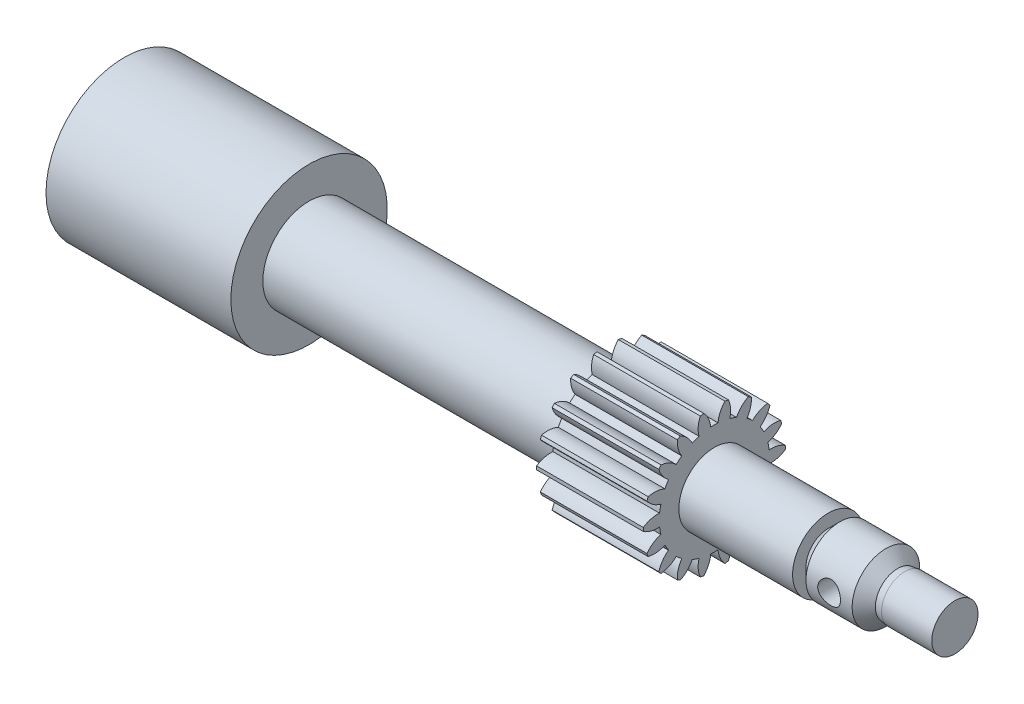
ISO-10303-21;
HEADER;
FILE_DESCRIPTION(('STEP AP214'),'2;1');
FILE_NAME('part.step','',(''),(''),'','','');
FILE_SCHEMA(('AUTOMOTIVE_DESIGN { 1 0 10303 214 1 1 1 1 }'));
ENDSEC;
DATA;
#1=APPLICATION_CONTEXT('core data for automotive mechanical design processes');
#2=APPLICATION_PROTOCOL_DEFINITION('international standard','automotive_design',2000,#1);
#3=PRODUCT_CONTEXT('',#1,'mechanical');
#4=PRODUCT('Part','Part','',(#3));
#5=PRODUCT_RELATED_PRODUCT_CATEGORY('part','',(#4));
#6=PRODUCT_DEFINITION_FORMATION('','',#4);
#7=PRODUCT_DEFINITION_CONTEXT('part definition',#1,'design');
#8=PRODUCT_DEFINITION('design','',#6,#7);
#9=PRODUCT_DEFINITION_SHAPE('','',#8);
#10=(LENGTH_UNIT() NAMED_UNIT(*) SI_UNIT(.MILLI.,.METRE.));
#11=(NAMED_UNIT(*) PLANE_ANGLE_UNIT() SI_UNIT($,.RADIAN.));
#12=(NAMED_UNIT(*) SI_UNIT($,.STERADIAN.) SOLID_ANGLE_UNIT());
#13=UNCERTAINTY_MEASURE_WITH_UNIT(LENGTH_MEASURE(1.E-05),#10,'distance_accuracy_value','');
#14=(GEOMETRIC_REPRESENTATION_CONTEXT(3) GLOBAL_UNCERTAINTY_ASSIGNED_CONTEXT((#13)) GLOBAL_UNIT_ASSIGNED_CONTEXT((#10,
#11,#12)) REPRESENTATION_CONTEXT('',''));
#15=CARTESIAN_POINT('',(0.,0.,0.));
#16=DIRECTION('',(0.,0.,1.));
#17=DIRECTION('',(1.,0.,0.));
#18=AXIS2_PLACEMENT_3D('',#15,#16,#17);
#19=CARTESIAN_POINT('',(15.,0.,0.));
#20=DIRECTION('',(-1.,0.,0.));
#21=DIRECTION('',(0.,0.,1.));
#22=AXIS2_PLACEMENT_3D('',#19,#20,#21);
#23=PLANE('',#22);
#24=CARTESIAN_POINT('',(15.,0.,0.));
#25=DIRECTION('',(1.,0.,0.));
#26=DIRECTION('',(0.,0.,-1.));
#27=AXIS2_PLACEMENT_3D('',#24,#25,#26);
#28=CIRCLE('',#27,5.);
#29=CARTESIAN_POINT('',(15.,0.,-5.));
#30=VERTEX_POINT('',#29);
#31=EDGE_CURVE('E52',#30,#30,#28,.T.);
#32=ORIENTED_EDGE('',*,*,#31,.F.);
#33=EDGE_LOOP('',(#32));
#34=FACE_BOUND('',#33,.T.);
#35=ADVANCED_FACE('F41',(#34),#23,.T.);
#36=CARTESIAN_POINT('',(48.8269547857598,0.,0.));
#37=DIRECTION('',(1.,0.,0.));
#38=DIRECTION('',(0.,0.,-1.));
#39=AXIS2_PLACEMENT_3D('',#36,#37,#38);
#40=CYLINDRICAL_SURFACE('',#39,5.);
#41=ORIENTED_EDGE('',*,*,#31,.T.);
#42=EDGE_LOOP('',(#41));
#43=FACE_BOUND('',#42,.T.);
#44=CARTESIAN_POINT('',(31.,0.,0.));
#45=DIRECTION('',(1.,0.,0.));
#46=DIRECTION('',(0.,0.,-1.));
#47=AXIS2_PLACEMENT_3D('',#44,#45,#46);
#48=CIRCLE('',#47,5.);
#49=CARTESIAN_POINT('',(31.,0.,-5.));
#50=VERTEX_POINT('',#49);
#51=EDGE_CURVE('E56',#50,#50,#48,.T.);
#52=ORIENTED_EDGE('',*,*,#51,.F.);
#53=EDGE_LOOP('',(#52));
#54=FACE_BOUND('',#53,.T.);
#55=ADVANCED_FACE('F92',(#43,#54),#40,.T.);
#56=CARTESIAN_POINT('',(31.,0.,-5.));
#57=DIRECTION('',(1.,0.,0.));
#58=DIRECTION('',(0.,0.,-1.));
#59=AXIS2_PLACEMENT_3D('',#56,#57,#58);
#60=PLANE('',#59);
#61=ORIENTED_EDGE('',*,*,#51,.T.);
#62=EDGE_LOOP('',(#61));
#63=FACE_BOUND('',#62,.T.);
#64=CARTESIAN_POINT('',(31.,0.,0.));
#65=DIRECTION('',(1.,0.,0.));
#66=DIRECTION('',(0.,0.,-1.));
#67=AXIS2_PLACEMENT_3D('',#64,#65,#66);
#68=CIRCLE('',#67,3.12);
#69=CARTESIAN_POINT('',(31.,0.,-3.12));
#70=VERTEX_POINT('',#69);
#71=EDGE_CURVE('E104',#70,#70,#68,.T.);
#72=ORIENTED_EDGE('',*,*,#71,.F.);
#73=EDGE_LOOP('',(#72));
#74=FACE_BOUND('',#73,.T.);
#75=ADVANCED_FACE('F97',(#63,#74),#60,.T.);
#76=CARTESIAN_POINT('',(32.63,0.,0.));
#77=DIRECTION('',(1.,0.,0.));
#78=DIRECTION('',(0.,0.,-1.));
#79=AXIS2_PLACEMENT_3D('',#76,#77,#78);
#80=CONICAL_SURFACE('',#79,4.75,0.785398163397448);
#81=ORIENTED_EDGE('',*,*,#71,.T.);
#82=EDGE_LOOP('',(#81));
#83=FACE_BOUND('',#82,.T.);
#84=CARTESIAN_POINT('',(32.63,0.,0.));
#85=DIRECTION('',(1.,0.,0.));
#86=DIRECTION('',(0.,0.,-1.));
#87=AXIS2_PLACEMENT_3D('',#84,#85,#86);
#88=CIRCLE('',#87,4.75);
#89=CARTESIAN_POINT('',(32.63,0.,-4.75));
#90=VERTEX_POINT('',#89);
#91=EDGE_CURVE('E106',#90,#90,#88,.T.);
#92=ORIENTED_EDGE('',*,*,#91,.F.);
#93=EDGE_LOOP('',(#92));
#94=FACE_BOUND('',#93,.T.);
#95=ADVANCED_FACE('F87',(#83,#94),#80,.T.);
#96=CARTESIAN_POINT('',(48.8269547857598,0.,0.));
#97=DIRECTION('',(1.,0.,0.));
#98=DIRECTION('',(0.,0.,-1.));
#99=AXIS2_PLACEMENT_3D('',#96,#97,#98);
#100=CYLINDRICAL_SURFACE('',#99,4.75);
#101=CARTESIAN_POINT('',(34.28,0.,4.75));
#102=CARTESIAN_POINT('',(34.2799994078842,-0.0872490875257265,4.75000038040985));
#103=CARTESIAN_POINT('',(34.2871597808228,-0.174494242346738,4.74757401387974));
#104=CARTESIAN_POINT('',(34.3155222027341,-0.346411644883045,4.73813402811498));
#105=CARTESIAN_POINT('',(34.3367254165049,-0.431083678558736,4.73112002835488));
#106=CARTESIAN_POINT('',(34.3923620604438,-0.595351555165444,4.71326617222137));
#107=CARTESIAN_POINT('',(34.4267730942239,-0.674955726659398,4.70243279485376));
#108=CARTESIAN_POINT('',(34.5077463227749,-0.827262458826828,4.67804376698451));
#109=CARTESIAN_POINT('',(34.5543109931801,-0.899963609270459,4.66448756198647));
#110=CARTESIAN_POINT('',(34.6599941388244,-1.03896524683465,4.63554255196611));
#111=CARTESIAN_POINT('',(34.7194647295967,-1.10498868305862,4.62010917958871));
#112=CARTESIAN_POINT('',(34.8485230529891,-1.22633764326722,4.58939230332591));
#113=CARTESIAN_POINT('',(34.9181130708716,-1.28166074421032,4.57410883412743));
#114=CARTESIAN_POINT('',(35.0679459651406,-1.38163422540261,4.5449296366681));
#115=CARTESIAN_POINT('',(35.14844236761,-1.42592198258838,4.53108808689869));
#116=CARTESIAN_POINT('',(35.3162823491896,-1.50021231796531,4.50703882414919));
#117=CARTESIAN_POINT('',(35.4036237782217,-1.53021936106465,4.49682997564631));
#118=CARTESIAN_POINT('',(35.5795204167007,-1.57405271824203,4.48167185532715));
#119=CARTESIAN_POINT('',(35.6679310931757,-1.58839901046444,4.47655409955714));
#120=CARTESIAN_POINT('',(35.8460414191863,-1.60212923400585,4.47165966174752));
#121=CARTESIAN_POINT('',(35.9357406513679,-1.60151790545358,4.47188128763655));
#122=CARTESIAN_POINT('',(36.1094226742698,-1.58575346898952,4.47749311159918));
#123=CARTESIAN_POINT('',(36.1934765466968,-1.57128217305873,4.48264096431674));
#124=CARTESIAN_POINT('',(36.3578852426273,-1.52932204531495,4.4971281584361));
#125=CARTESIAN_POINT('',(36.4382396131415,-1.50183162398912,4.50646801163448));
#126=CARTESIAN_POINT('',(36.5945044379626,-1.43417324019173,4.52845730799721));
#127=CARTESIAN_POINT('',(36.6703207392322,-1.39380532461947,4.54115837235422));
#128=CARTESIAN_POINT('',(36.8143174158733,-1.30167667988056,4.56841772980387));
#129=CARTESIAN_POINT('',(36.8824955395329,-1.2499126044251,4.58297656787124));
#130=CARTESIAN_POINT('',(37.0131074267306,-1.1331989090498,4.61326117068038));
#131=CARTESIAN_POINT('',(37.075040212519,-1.06769289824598,4.62900773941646));
#132=CARTESIAN_POINT('',(37.1871736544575,-0.92703158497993,4.65921460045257));
#133=CARTESIAN_POINT('',(37.237373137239,-0.851875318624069,4.6736747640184));
#134=CARTESIAN_POINT('',(37.3250297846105,-0.692967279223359,4.69987642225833));
#135=CARTESIAN_POINT('',(37.3623501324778,-0.609134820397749,4.71158832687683));
#136=CARTESIAN_POINT('',(37.4222023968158,-0.43589245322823,4.73075873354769));
#137=CARTESIAN_POINT('',(37.4447395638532,-0.346484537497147,4.73821874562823));
#138=CARTESIAN_POINT('',(37.4734921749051,-0.168868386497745,4.7477934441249));
#139=CARTESIAN_POINT('',(37.480384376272,-0.0807815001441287,4.75012961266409));
#140=CARTESIAN_POINT('',(37.4795826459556,0.0953093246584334,4.74985927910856));
#141=CARTESIAN_POINT('',(37.4718912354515,0.183313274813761,4.74725363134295));
#142=CARTESIAN_POINT('',(37.4426746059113,0.354014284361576,4.73753867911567));
#143=CARTESIAN_POINT('',(37.4215670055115,0.436791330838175,4.73056542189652));
#144=CARTESIAN_POINT('',(37.3666415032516,0.597594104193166,4.71295334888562));
#145=CARTESIAN_POINT('',(37.3328219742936,0.675619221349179,4.7023140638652));
#146=CARTESIAN_POINT('',(37.2524365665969,0.827018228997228,4.67809557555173));
#147=CARTESIAN_POINT('',(37.2055554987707,0.900213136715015,4.66444568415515));
#148=CARTESIAN_POINT('',(37.1007468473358,1.03791595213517,4.63575085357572));
#149=CARTESIAN_POINT('',(37.042815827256,1.1024211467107,4.62070548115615));
#150=CARTESIAN_POINT('',(36.9143702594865,1.22403306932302,4.59002843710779));
#151=CARTESIAN_POINT('',(36.8433961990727,1.28065696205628,4.57440199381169));
#152=CARTESIAN_POINT('',(36.6926197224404,1.38125352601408,4.54504056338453));
#153=CARTESIAN_POINT('',(36.6128171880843,1.42522602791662,4.5313056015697));
#154=CARTESIAN_POINT('',(36.4465739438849,1.49908290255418,4.50741207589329));
#155=CARTESIAN_POINT('',(36.3601443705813,1.52899033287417,4.49724766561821));
#156=CARTESIAN_POINT('',(36.1830526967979,1.57368631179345,4.48180560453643));
#157=CARTESIAN_POINT('',(36.0923925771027,1.58848186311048,4.47652569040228));
#158=CARTESIAN_POINT('',(35.9145282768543,1.60198092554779,4.47171143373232));
#159=CARTESIAN_POINT('',(35.8273921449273,1.60148753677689,4.47189034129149));
#160=CARTESIAN_POINT('',(35.6545139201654,1.58640577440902,4.47726248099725));
#161=CARTESIAN_POINT('',(35.5687717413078,1.57181827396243,4.48245540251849));
#162=CARTESIAN_POINT('',(35.4028087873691,1.52953586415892,4.49705477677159));
#163=CARTESIAN_POINT('',(35.3225122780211,1.50210636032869,4.50637571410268));
#164=CARTESIAN_POINT('',(35.1676004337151,1.43513490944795,4.52814772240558));
#165=CARTESIAN_POINT('',(35.0929863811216,1.39559023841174,4.54059949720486));
#166=CARTESIAN_POINT('',(34.9479663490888,1.30346337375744,4.56791922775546));
#167=CARTESIAN_POINT('',(34.8778942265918,1.25038033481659,4.58286990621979));
#168=CARTESIAN_POINT('',(34.7473930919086,1.13352439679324,4.61316175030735));
#169=CARTESIAN_POINT('',(34.6869668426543,1.06974844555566,4.62850302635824));
#170=CARTESIAN_POINT('',(34.5750269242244,0.930245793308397,4.65858641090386));
#171=CARTESIAN_POINT('',(34.5239680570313,0.854142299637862,4.67327979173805));
#172=CARTESIAN_POINT('',(34.4354206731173,0.69394572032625,4.69973591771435));
#173=CARTESIAN_POINT('',(34.3979290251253,0.609854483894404,4.71149933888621));
#174=CARTESIAN_POINT('',(34.3389524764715,0.439319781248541,4.73038842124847));
#175=CARTESIAN_POINT('',(34.3169173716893,0.353084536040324,4.73767221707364));
#176=CARTESIAN_POINT('',(34.2874435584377,0.177897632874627,4.74747711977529));
#177=CARTESIAN_POINT('',(34.2800006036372,0.088946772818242,4.74999961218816));
#178=CARTESIAN_POINT('',(34.28,0.,4.75));
#179=B_SPLINE_CURVE_WITH_KNOTS('',3,(#101,#102,#103,#104,#105,#106,#107,#108,#109,#110,#111,
#112,#113,#114,#115,#116,#117,#118,#119,#120,#121,#122,#123,#124,#125,#126,#127,#128,#129,#130,
#131,#132,#133,#134,#135,#136,#137,#138,#139,#140,#141,#142,#143,#144,#145,#146,#147,#148,#149,
#150,#151,#152,#153,#154,#155,#156,#157,#158,#159,#160,#161,#162,#163,#164,#165,#166,#167,#168,
#169,#170,#171,#172,#173,#174,#175,#176,#177,#178),.UNSPECIFIED.,.T.,.F.,(4,2,2,2,2,2,2,2,2,2,2,
2,2,2,2,2,2,2,2,2,2,2,2,2,2,2,2,2,2,2,2,2,2,2,2,2,2,2,4),(0.,0.26141988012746,0.522861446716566,
0.783861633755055,1.04491502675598,1.31426971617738,1.58368532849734,1.86104160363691,
2.13831110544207,2.40606472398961,2.6737334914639,2.92887686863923,3.18405140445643,
3.44339856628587,3.70282198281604,3.97609492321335,4.24939518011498,4.52551529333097,
4.80153728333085,5.06537129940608,5.32915970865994,5.58511415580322,5.84110137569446,
6.1038993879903,6.36677926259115,6.64186990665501,6.91696423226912,7.19160599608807,
7.46612043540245,7.72624083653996,7.98634512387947,8.24129630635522,8.49630485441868,
8.76263407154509,9.02903943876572,9.30613233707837,9.58316124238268,9.84974539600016,
10.1162519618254),.UNSPECIFIED.);
#180=CARTESIAN_POINT('',(34.28,0.,4.75));
#181=VERTEX_POINT('',#180);
#182=EDGE_CURVE('E44',#181,#181,#179,.T.);
#183=ORIENTED_EDGE('',*,*,#182,.F.);
#184=EDGE_LOOP('',(#183));
#185=FACE_BOUND('',#184,.T.);
#186=CARTESIAN_POINT('',(34.28,0.,-4.75));
#187=CARTESIAN_POINT('',(34.2799994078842,0.0872490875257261,-4.75000038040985));
#188=CARTESIAN_POINT('',(34.2871597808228,0.174494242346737,-4.74757401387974));
#189=CARTESIAN_POINT('',(34.3155222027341,0.346411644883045,-4.73813402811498));
#190=CARTESIAN_POINT('',(34.3367254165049,0.431083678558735,-4.73112002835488));
#191=CARTESIAN_POINT('',(34.3923620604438,0.595351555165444,-4.71326617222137));
#192=CARTESIAN_POINT('',(34.4267730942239,0.674955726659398,-4.70243279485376));
#193=CARTESIAN_POINT('',(34.5077463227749,0.827262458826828,-4.67804376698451));
#194=CARTESIAN_POINT('',(34.5543109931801,0.899963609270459,-4.66448756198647));
#195=CARTESIAN_POINT('',(34.6599941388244,1.03896524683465,-4.63554255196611));
#196=CARTESIAN_POINT('',(34.7194647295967,1.10498868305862,-4.62010917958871));
#197=CARTESIAN_POINT('',(34.8485230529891,1.22633764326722,-4.58939230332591));
#198=CARTESIAN_POINT('',(34.9181130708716,1.28166074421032,-4.57410883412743));
#199=CARTESIAN_POINT('',(35.0679459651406,1.38163422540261,-4.5449296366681));
#200=CARTESIAN_POINT('',(35.14844236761,1.42592198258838,-4.53108808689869));
#201=CARTESIAN_POINT('',(35.3162823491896,1.50021231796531,-4.50703882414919));
#202=CARTESIAN_POINT('',(35.4036237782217,1.53021936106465,-4.49682997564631));
#203=CARTESIAN_POINT('',(35.5795204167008,1.57405271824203,-4.48167185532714));
#204=CARTESIAN_POINT('',(35.6679310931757,1.58839901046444,-4.47655409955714));
#205=CARTESIAN_POINT('',(35.8460414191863,1.60212923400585,-4.47165966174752));
#206=CARTESIAN_POINT('',(35.9357406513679,1.60151790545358,-4.47188128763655));
#207=CARTESIAN_POINT('',(36.1094226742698,1.58575346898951,-4.47749311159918));
#208=CARTESIAN_POINT('',(36.1934765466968,1.57128217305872,-4.48264096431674));
#209=CARTESIAN_POINT('',(36.3578852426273,1.52932204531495,-4.49712815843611));
#210=CARTESIAN_POINT('',(36.4382396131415,1.50183162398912,-4.50646801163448));
#211=CARTESIAN_POINT('',(36.5945044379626,1.43417324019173,-4.52845730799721));
#212=CARTESIAN_POINT('',(36.6703207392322,1.39380532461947,-4.54115837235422));
#213=CARTESIAN_POINT('',(36.8143174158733,1.30167667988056,-4.56841772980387));
#214=CARTESIAN_POINT('',(36.8824955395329,1.2499126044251,-4.58297656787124));
#215=CARTESIAN_POINT('',(37.0131074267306,1.1331989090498,-4.61326117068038));
#216=CARTESIAN_POINT('',(37.075040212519,1.06769289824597,-4.62900773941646));
#217=CARTESIAN_POINT('',(37.1871736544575,0.927031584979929,-4.65921460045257));
#218=CARTESIAN_POINT('',(37.237373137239,0.851875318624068,-4.6736747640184));
#219=CARTESIAN_POINT('',(37.3250297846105,0.692967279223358,-4.69987642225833));
#220=CARTESIAN_POINT('',(37.3623501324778,0.609134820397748,-4.71158832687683));
#221=CARTESIAN_POINT('',(37.4222023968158,0.435892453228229,-4.73075873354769));
#222=CARTESIAN_POINT('',(37.4447395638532,0.346484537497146,-4.73821874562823));
#223=CARTESIAN_POINT('',(37.4734921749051,0.168868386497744,-4.7477934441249));
#224=CARTESIAN_POINT('',(37.480384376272,0.0807815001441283,-4.75012961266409));
#225=CARTESIAN_POINT('',(37.4795826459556,-0.0953093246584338,-4.74985927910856));
#226=CARTESIAN_POINT('',(37.4718912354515,-0.183313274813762,-4.74725363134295));
#227=CARTESIAN_POINT('',(37.4426746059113,-0.354014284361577,-4.73753867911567));
#228=CARTESIAN_POINT('',(37.4215670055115,-0.436791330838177,-4.73056542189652));
#229=CARTESIAN_POINT('',(37.3666415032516,-0.597594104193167,-4.71295334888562));
#230=CARTESIAN_POINT('',(37.3328219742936,-0.67561922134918,-4.7023140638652));
#231=CARTESIAN_POINT('',(37.2524365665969,-0.827018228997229,-4.67809557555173));
#232=CARTESIAN_POINT('',(37.2055554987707,-0.900213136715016,-4.66444568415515));
#233=CARTESIAN_POINT('',(37.1007468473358,-1.03791595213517,-4.63575085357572));
#234=CARTESIAN_POINT('',(37.042815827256,-1.1024211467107,-4.62070548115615));
#235=CARTESIAN_POINT('',(36.9143702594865,-1.22403306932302,-4.59002843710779));
#236=CARTESIAN_POINT('',(36.8433961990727,-1.28065696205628,-4.57440199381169));
#237=CARTESIAN_POINT('',(36.6926197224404,-1.38125352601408,-4.54504056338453));
#238=CARTESIAN_POINT('',(36.6128171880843,-1.42522602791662,-4.5313056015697));
#239=CARTESIAN_POINT('',(36.4465739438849,-1.49908290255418,-4.50741207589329));
#240=CARTESIAN_POINT('',(36.3601443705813,-1.52899033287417,-4.49724766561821));
#241=CARTESIAN_POINT('',(36.1830526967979,-1.57368631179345,-4.48180560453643));
#242=CARTESIAN_POINT('',(36.0923925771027,-1.58848186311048,-4.47652569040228));
#243=CARTESIAN_POINT('',(35.9145282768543,-1.60198092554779,-4.47171143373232));
#244=CARTESIAN_POINT('',(35.8273921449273,-1.60148753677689,-4.47189034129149));
#245=CARTESIAN_POINT('',(35.6545139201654,-1.58640577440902,-4.47726248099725));
#246=CARTESIAN_POINT('',(35.5687717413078,-1.57181827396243,-4.48245540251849));
#247=CARTESIAN_POINT('',(35.4028087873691,-1.52953586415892,-4.49705477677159));
#248=CARTESIAN_POINT('',(35.3225122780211,-1.50210636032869,-4.50637571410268));
#249=CARTESIAN_POINT('',(35.1676004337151,-1.43513490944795,-4.52814772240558));
#250=CARTESIAN_POINT('',(35.0929863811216,-1.39559023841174,-4.54059949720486));
#251=CARTESIAN_POINT('',(34.9479663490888,-1.30346337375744,-4.56791922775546));
#252=CARTESIAN_POINT('',(34.8778942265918,-1.25038033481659,-4.58286990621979));
#253=CARTESIAN_POINT('',(34.7473930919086,-1.13352439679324,-4.61316175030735));
#254=CARTESIAN_POINT('',(34.6869668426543,-1.06974844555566,-4.62850302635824));
#255=CARTESIAN_POINT('',(34.5750269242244,-0.930245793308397,-4.65858641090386));
#256=CARTESIAN_POINT('',(34.5239680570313,-0.854142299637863,-4.67327979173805));
#257=CARTESIAN_POINT('',(34.4354206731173,-0.693945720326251,-4.69973591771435));
#258=CARTESIAN_POINT('',(34.3979290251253,-0.609854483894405,-4.71149933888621));
#259=CARTESIAN_POINT('',(34.3389524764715,-0.439319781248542,-4.73038842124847));
#260=CARTESIAN_POINT('',(34.3169173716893,-0.353084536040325,-4.73767221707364));
#261=CARTESIAN_POINT('',(34.2874435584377,-0.177897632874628,-4.74747711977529));
#262=CARTESIAN_POINT('',(34.2800006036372,-0.0889467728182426,-4.74999961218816));
#263=CARTESIAN_POINT('',(34.28,0.,-4.75));
#264=B_SPLINE_CURVE_WITH_KNOTS('',3,(#186,#187,#188,#189,#190,#191,#192,#193,#194,#195,#196,
#197,#198,#199,#200,#201,#202,#203,#204,#205,#206,#207,#208,#209,#210,#211,#212,#213,#214,#215,
#216,#217,#218,#219,#220,#221,#222,#223,#224,#225,#226,#227,#228,#229,#230,#231,#232,#233,#234,
#235,#236,#237,#238,#239,#240,#241,#242,#243,#244,#245,#246,#247,#248,#249,#250,#251,#252,#253,
#254,#255,#256,#257,#258,#259,#260,#261,#262,#263),.UNSPECIFIED.,.T.,.F.,(4,2,2,2,2,2,2,2,2,2,2,
2,2,2,2,2,2,2,2,2,2,2,2,2,2,2,2,2,2,2,2,2,2,2,2,2,2,2,4),(0.,0.26141988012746,0.522861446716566,
0.783861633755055,1.04491502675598,1.31426971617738,1.58368532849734,1.86104160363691,
2.13831110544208,2.40606472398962,2.67373349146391,2.92887686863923,3.18405140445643,
3.44339856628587,3.70282198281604,3.97609492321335,4.24939518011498,4.52551529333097,
4.80153728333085,5.06537129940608,5.32915970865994,5.58511415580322,5.84110137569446,
6.1038993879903,6.36677926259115,6.64186990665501,6.91696423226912,7.19160599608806,
7.46612043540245,7.72624083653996,7.98634512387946,8.24129630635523,8.49630485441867,
8.76263407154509,9.02903943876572,9.30613233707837,9.58316124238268,9.84974539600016,
10.1162519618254),.UNSPECIFIED.);
#265=CARTESIAN_POINT('',(34.28,0.,-4.75));
#266=VERTEX_POINT('',#265);
#267=EDGE_CURVE('E11',#266,#266,#264,.T.);
#268=ORIENTED_EDGE('',*,*,#267,.F.);
#269=EDGE_LOOP('',(#268));
#270=FACE_BOUND('',#269,.T.);
#271=ORIENTED_EDGE('',*,*,#91,.T.);
#272=EDGE_LOOP('',(#271));
#273=FACE_BOUND('',#272,.T.);
#274=CARTESIAN_POINT('',(39.13,0.,0.));
#275=DIRECTION('',(1.,0.,0.));
#276=DIRECTION('',(0.,0.,-1.));
#277=AXIS2_PLACEMENT_3D('',#274,#275,#276);
#278=CIRCLE('',#277,4.75);
#279=CARTESIAN_POINT('',(39.13,0.,-4.75));
#280=VERTEX_POINT('',#279);
#281=EDGE_CURVE('E111',#280,#280,#278,.T.);
#282=ORIENTED_EDGE('',*,*,#281,.F.);
#283=EDGE_LOOP('',(#282));
#284=FACE_BOUND('',#283,.T.);
#285=ADVANCED_FACE('F61',(#185,#270,#273,#284),#100,.T.);
#286=CARTESIAN_POINT('',(40.76,0.,0.));
#287=DIRECTION('',(-1.,0.,0.));
#288=DIRECTION('',(0.,0.,1.));
#289=AXIS2_PLACEMENT_3D('',#286,#287,#288);
#290=CONICAL_SURFACE('',#289,3.12,0.785398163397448);
#291=ORIENTED_EDGE('',*,*,#281,.T.);
#292=EDGE_LOOP('',(#291));
#293=FACE_BOUND('',#292,.T.);
#294=CARTESIAN_POINT('',(40.76,0.,0.));
#295=DIRECTION('',(1.,0.,0.));
#296=DIRECTION('',(0.,0.,-1.));
#297=AXIS2_PLACEMENT_3D('',#294,#295,#296);
#298=CIRCLE('',#297,3.12);
#299=CARTESIAN_POINT('',(40.76,0.,-3.12));
#300=VERTEX_POINT('',#299);
#301=EDGE_CURVE('E113',#300,#300,#298,.T.);
#302=ORIENTED_EDGE('',*,*,#301,.F.);
#303=EDGE_LOOP('',(#302));
#304=FACE_BOUND('',#303,.T.);
#305=ADVANCED_FACE('F80',(#293,#304),#290,.T.);
#306=CARTESIAN_POINT('',(41.76,0.,0.));
#307=DIRECTION('',(1.,0.,0.));
#308=DIRECTION('',(0.,0.,-1.));
#309=AXIS2_PLACEMENT_3D('',#306,#307,#308);
#310=CONICAL_SURFACE('',#309,3.25,0.129275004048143);
#311=ORIENTED_EDGE('',*,*,#301,.T.);
#312=EDGE_LOOP('',(#311));
#313=FACE_BOUND('',#312,.T.);
#314=CARTESIAN_POINT('',(41.76,0.,0.));
#315=DIRECTION('',(1.,0.,0.));
#316=DIRECTION('',(0.,0.,-1.));
#317=AXIS2_PLACEMENT_3D('',#314,#315,#316);
#318=CIRCLE('',#317,3.25);
#319=CARTESIAN_POINT('',(41.76,0.,-3.25));
#320=VERTEX_POINT('',#319);
#321=EDGE_CURVE('E116',#320,#320,#318,.T.);
#322=ORIENTED_EDGE('',*,*,#321,.F.);
#323=EDGE_LOOP('',(#322));
#324=FACE_BOUND('',#323,.T.);
#325=ADVANCED_FACE('F77',(#313,#324),#310,.T.);
#326=CARTESIAN_POINT('',(48.8269547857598,0.,0.));
#327=DIRECTION('',(1.,0.,0.));
#328=DIRECTION('',(0.,0.,-1.));
#329=AXIS2_PLACEMENT_3D('',#326,#327,#328);
#330=CYLINDRICAL_SURFACE('',#329,3.25);
#331=ORIENTED_EDGE('',*,*,#321,.T.);
#332=EDGE_LOOP('',(#331));
#333=FACE_BOUND('',#332,.T.);
#334=CARTESIAN_POINT('',(48.8269547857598,0.,0.));
#335=DIRECTION('',(1.,0.,0.));
#336=DIRECTION('',(0.,0.,-1.));
#337=AXIS2_PLACEMENT_3D('',#334,#335,#336);
#338=CIRCLE('',#337,3.25);
#339=CARTESIAN_POINT('',(48.8269547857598,0.,-3.25));
#340=VERTEX_POINT('',#339);
#341=EDGE_CURVE('E119',#340,#340,#338,.T.);
#342=ORIENTED_EDGE('',*,*,#341,.F.);
#343=EDGE_LOOP('',(#342));
#344=FACE_BOUND('',#343,.T.);
#345=ADVANCED_FACE('F73',(#333,#344),#330,.T.);
#346=CARTESIAN_POINT('',(48.8269547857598,0.,0.));
#347=DIRECTION('',(1.,0.,0.));
#348=DIRECTION('',(0.,0.,-1.));
#349=AXIS2_PLACEMENT_3D('',#346,#347,#348);
#350=PLANE('',#349);
#351=ORIENTED_EDGE('',*,*,#341,.T.);
#352=EDGE_LOOP('',(#351));
#353=FACE_BOUND('',#352,.T.);
#354=ADVANCED_FACE('F69',(#353),#350,.T.);
#355=CARTESIAN_POINT('',(35.88,0.,11.));
#356=DIRECTION('',(0.,0.,-1.));
#357=DIRECTION('',(-1.,0.,0.));
#358=AXIS2_PLACEMENT_3D('',#355,#356,#357);
#359=CYLINDRICAL_SURFACE('',#358,1.6);
#360=ORIENTED_EDGE('',*,*,#267,.T.);
#361=EDGE_LOOP('',(#360));
#362=FACE_BOUND('',#361,.T.);
#363=ORIENTED_EDGE('',*,*,#182,.T.);
#364=EDGE_LOOP('',(#363));
#365=FACE_BOUND('',#364,.T.);
#366=ADVANCED_FACE('F65',(#362,#365),#359,.F.);
#367=CLOSED_SHELL('',(#35,#55,#75,#95,#285,#305,#325,#345,#354,#366));
#368=MANIFOLD_SOLID_BREP('B2',#367);
#369=CARTESIAN_POINT('',(0.,0.,0.));
#370=DIRECTION('',(1.,0.,0.));
#371=DIRECTION('',(0.,0.,-1.));
#372=AXIS2_PLACEMENT_3D('',#369,#370,#371);
#373=PLANE('',#372);
#374=CARTESIAN_POINT('',(0.,5.5526722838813,-6.37907755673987));
#375=DIRECTION('',(-1.,0.,0.));
#376=DIRECTION('',(0.,-0.342020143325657,-0.939692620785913));
#377=AXIS2_PLACEMENT_3D('',#374,#375,#376);
#378=CIRCLE('',#377,3.6);
#379=CARTESIAN_POINT('',(0.,7.09120084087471,-3.12439940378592));
#380=VERTEX_POINT('',#379);
#381=CARTESIAN_POINT('',(0.,8.78068216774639,-4.78535481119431));
#382=VERTEX_POINT('',#381);
#383=EDGE_CURVE('E216',#380,#382,#378,.T.);
#384=ORIENTED_EDGE('',*,*,#383,.T.);
#385=CARTESIAN_POINT('',(0.,0.,0.));
#386=DIRECTION('',(-1.,0.,0.));
#387=DIRECTION('',(0.,0.,1.));
#388=AXIS2_PLACEMENT_3D('',#385,#386,#387);
#389=CIRCLE('',#388,10.);
#390=CARTESIAN_POINT('',(0.,8.53457991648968,-5.21161641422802));
#391=VERTEX_POINT('',#390);
#392=EDGE_CURVE('E1061',#382,#391,#389,.T.);
#393=ORIENTED_EDGE('',*,*,#392,.T.);
#394=CARTESIAN_POINT('',(0.,8.30077935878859,-1.61921647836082));
#395=DIRECTION('',(1.,0.,0.));
#396=DIRECTION('',(0.,0.,-1.));
#397=AXIS2_PLACEMENT_3D('',#394,#395,#396);
#398=CIRCLE('',#397,3.6);
#399=CARTESIAN_POINT('',(0.,6.25140967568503,-4.57896036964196));
#400=VERTEX_POINT('',#399);
#401=EDGE_CURVE('E1113',#400,#391,#398,.T.);
#402=ORIENTED_EDGE('',*,*,#401,.F.);
#403=CARTESIAN_POINT('',(0.,0.,0.));
#404=DIRECTION('',(-1.,0.,0.));
#405=DIRECTION('',(0.,-0.64278760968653,-0.766044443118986));
#406=AXIS2_PLACEMENT_3D('',#403,#404,#405);
#407=CIRCLE('',#406,7.749);
#408=CARTESIAN_POINT('',(0.,5.5949415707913,-5.36130859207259));
#409=VERTEX_POINT('',#408);
#410=EDGE_CURVE('E688',#400,#409,#407,.T.);
#411=ORIENTED_EDGE('',*,*,#410,.T.);
#412=CARTESIAN_POINT('',(0.,3.03603215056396,-7.89349787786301));
#413=DIRECTION('',(-1.,0.,0.));
#414=DIRECTION('',(0.,-0.64278760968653,-0.766044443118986));
#415=AXIS2_PLACEMENT_3D('',#412,#413,#414);
#416=CIRCLE('',#415,3.6);
#417=CARTESIAN_POINT('',(0.,6.61445450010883,-7.4999327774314));
#418=VERTEX_POINT('',#417);
#419=EDGE_CURVE('E224',#409,#418,#416,.T.);
#420=ORIENTED_EDGE('',*,*,#419,.T.);
#421=CARTESIAN_POINT('',(0.,6.23740397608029,-7.81631573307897));
#422=VERTEX_POINT('',#421);
#423=EDGE_CURVE('E1234',#418,#422,#389,.T.);
#424=ORIENTED_EDGE('',*,*,#423,.T.);
#425=CARTESIAN_POINT('',(0.,7.24637645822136,-4.36059952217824));
#426=DIRECTION('',(1.,0.,0.));
#427=DIRECTION('',(0.,0.,-1.));
#428=AXIS2_PLACEMENT_3D('',#425,#426,#427);
#429=CIRCLE('',#428,3.6);
#430=CARTESIAN_POINT('',(0.,4.30830685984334,-6.44092330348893));
#431=VERTEX_POINT('',#430);
#432=EDGE_CURVE('E1110',#431,#422,#429,.T.);
#433=ORIENTED_EDGE('',*,*,#432,.F.);
#434=CARTESIAN_POINT('',(0.,0.,0.));
#435=DIRECTION('',(-1.,0.,0.));
#436=DIRECTION('',(0.,-0.866025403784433,-0.50000000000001));
#437=AXIS2_PLACEMENT_3D('',#434,#435,#436);
#438=CIRCLE('',#437,7.749);
#439=CARTESIAN_POINT('',(0.,3.42384977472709,-6.95156483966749));
#440=VERTEX_POINT('',#439);
#441=EDGE_CURVE('E708',#431,#440,#438,.T.);
#442=ORIENTED_EDGE('',*,*,#441,.T.);
#443=CARTESIAN_POINT('',(0.,0.153201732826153,-8.45584585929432));
#444=DIRECTION('',(-1.,0.,0.));
#445=DIRECTION('',(0.,-0.866025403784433,-0.50000000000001));
#446=AXIS2_PLACEMENT_3D('',#443,#444,#445);
#447=CIRCLE('',#446,3.6);
#448=CARTESIAN_POINT('',(0.,3.65042600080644,-9.30990816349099));
#449=VERTEX_POINT('',#448);
#450=EDGE_CURVE('E704',#440,#449,#447,.T.);
#451=ORIENTED_EDGE('',*,*,#450,.T.);
#452=CARTESIAN_POINT('',(0.,3.18790506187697,-9.47825201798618));
#453=VERTEX_POINT('',#452);
#454=EDGE_CURVE('E1246',#449,#453,#389,.T.);
#455=ORIENTED_EDGE('',*,*,#454,.T.);
#456=CARTESIAN_POINT('',(0.,5.31795361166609,-6.57602990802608));
#457=DIRECTION('',(1.,0.,0.));
#458=DIRECTION('',(0.,0.,-1.));
#459=AXIS2_PLACEMENT_3D('',#456,#457,#458);
#460=CIRCLE('',#459,3.6);
#461=CARTESIAN_POINT('',(0.,1.84555865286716,-7.52601582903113));
#462=VERTEX_POINT('',#461);
#463=EDGE_CURVE('E1107',#462,#453,#460,.T.);
#464=ORIENTED_EDGE('',*,*,#463,.F.);
#465=CARTESIAN_POINT('',(0.,0.,0.));
#466=DIRECTION('',(-1.,0.,0.));
#467=DIRECTION('',(0.,-0.984807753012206,-0.17364817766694));
#468=AXIS2_PLACEMENT_3D('',#465,#466,#467);
#469=CIRCLE('',#468,7.749);
#470=CARTESIAN_POINT('',(0.,0.83979116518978,-7.70335977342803));
#471=VERTEX_POINT('',#470);
#472=EDGE_CURVE('E730',#462,#471,#469,.T.);
#473=ORIENTED_EDGE('',*,*,#472,.T.);
#474=CARTESIAN_POINT('',(0.,-2.74810707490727,-7.99829403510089));
#475=DIRECTION('',(-1.,0.,0.));
#476=DIRECTION('',(0.,-0.984807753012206,-0.17364817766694));
#477=AXIS2_PLACEMENT_3D('',#474,#475,#476);
#478=CIRCLE('',#477,3.6);
#479=CARTESIAN_POINT('',(0.,0.246102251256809,-9.99697122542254));
#480=VERTEX_POINT('',#479);
#481=EDGE_CURVE('E726',#471,#480,#478,.T.);
#482=ORIENTED_EDGE('',*,*,#481,.T.);
#483=CARTESIAN_POINT('',(0.,-0.246102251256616,-9.99697122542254));
#484=VERTEX_POINT('',#483);
#485=EDGE_CURVE('E1247',#480,#484,#389,.T.);
#486=ORIENTED_EDGE('',*,*,#485,.T.);
#487=CARTESIAN_POINT('',(0.,2.74810707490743,-7.99829403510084));
#488=DIRECTION('',(1.,0.,0.));
#489=DIRECTION('',(0.,0.,-1.));
#490=AXIS2_PLACEMENT_3D('',#487,#488,#489);
#491=CIRCLE('',#490,3.6);
#492=CARTESIAN_POINT('',(0.,-0.839791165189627,-7.70335977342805));
#493=VERTEX_POINT('',#492);
#494=EDGE_CURVE('E1104',#493,#484,#491,.T.);
#495=ORIENTED_EDGE('',*,*,#494,.F.);
#496=CARTESIAN_POINT('',(0.,0.,0.));
#497=DIRECTION('',(-1.,0.,0.));
#498=DIRECTION('',(0.,-0.98480775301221,0.173648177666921));
#499=AXIS2_PLACEMENT_3D('',#496,#497,#498);
#500=CIRCLE('',#499,7.749);
#501=CARTESIAN_POINT('',(0.,-1.84555865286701,-7.52601582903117));
#502=VERTEX_POINT('',#501);
#503=EDGE_CURVE('E752',#493,#502,#500,.T.);
#504=ORIENTED_EDGE('',*,*,#503,.T.);
#505=CARTESIAN_POINT('',(0.,-5.31795361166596,-6.57602990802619));
#506=DIRECTION('',(-1.,0.,0.));
#507=DIRECTION('',(0.,-0.98480775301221,0.173648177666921));
#508=AXIS2_PLACEMENT_3D('',#505,#506,#507);
#509=CIRCLE('',#508,3.6);
#510=CARTESIAN_POINT('',(0.,-3.18790506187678,-9.47825201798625));
#511=VERTEX_POINT('',#510);
#512=EDGE_CURVE('E748',#502,#511,#509,.T.);
#513=ORIENTED_EDGE('',*,*,#512,.T.);
#514=CARTESIAN_POINT('',(0.,-3.65042600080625,-9.30990816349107));
#515=VERTEX_POINT('',#514);
#516=EDGE_CURVE('E1250',#511,#515,#389,.T.);
#517=ORIENTED_EDGE('',*,*,#516,.T.);
#518=CARTESIAN_POINT('',(0.,-0.153201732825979,-8.45584585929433));
#519=DIRECTION('',(1.,0.,0.));
#520=DIRECTION('',(0.,0.,-1.));
#521=AXIS2_PLACEMENT_3D('',#518,#519,#520);
#522=CIRCLE('',#521,3.6);
#523=CARTESIAN_POINT('',(0.,-3.42384977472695,-6.95156483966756));
#524=VERTEX_POINT('',#523);
#525=EDGE_CURVE('E1101',#524,#515,#522,.T.);
#526=ORIENTED_EDGE('',*,*,#525,.F.);
#527=CARTESIAN_POINT('',(0.,0.,0.));
#528=DIRECTION('',(-1.,0.,0.));
#529=DIRECTION('',(0.,-0.866025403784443,0.499999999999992));
#530=AXIS2_PLACEMENT_3D('',#527,#528,#529);
#531=CIRCLE('',#530,7.749);
#532=CARTESIAN_POINT('',(0.,-4.30830685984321,-6.44092330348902));
#533=VERTEX_POINT('',#532);
#534=EDGE_CURVE('E774',#524,#533,#531,.T.);
#535=ORIENTED_EDGE('',*,*,#534,.T.);
#536=CARTESIAN_POINT('',(0.,-7.24637645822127,-4.36059952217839));
#537=DIRECTION('',(-1.,0.,0.));
#538=DIRECTION('',(0.,-0.866025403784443,0.499999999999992));
#539=AXIS2_PLACEMENT_3D('',#536,#537,#538);
#540=CIRCLE('',#539,3.6);
#541=CARTESIAN_POINT('',(0.,-6.23740397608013,-7.81631573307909));
#542=VERTEX_POINT('',#541);
#543=EDGE_CURVE('E770',#533,#542,#540,.T.);
#544=ORIENTED_EDGE('',*,*,#543,.T.);
#545=CARTESIAN_POINT('',(0.,-6.61445450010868,-7.49993277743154));
#546=VERTEX_POINT('',#545);
#547=EDGE_CURVE('E1253',#542,#546,#389,.T.);
#548=ORIENTED_EDGE('',*,*,#547,.T.);
#549=CARTESIAN_POINT('',(0.,-3.0360321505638,-7.89349787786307));
#550=DIRECTION('',(1.,0.,0.));
#551=DIRECTION('',(0.,0.,-1.));
#552=AXIS2_PLACEMENT_3D('',#549,#550,#551);
#553=CIRCLE('',#552,3.6);
#554=CARTESIAN_POINT('',(0.,-5.59494157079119,-5.3613085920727));
#555=VERTEX_POINT('',#554);
#556=EDGE_CURVE('E1098',#555,#546,#553,.T.);
#557=ORIENTED_EDGE('',*,*,#556,.F.);
#558=CARTESIAN_POINT('',(0.,0.,0.));
#559=DIRECTION('',(-1.,0.,0.));
#560=DIRECTION('',(0.,-0.642787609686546,0.766044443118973));
#561=AXIS2_PLACEMENT_3D('',#558,#559,#560);
#562=CIRCLE('',#561,7.749);
#563=CARTESIAN_POINT('',(0.,-6.25140967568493,-4.57896036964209));
#564=VERTEX_POINT('',#563);
#565=EDGE_CURVE('E796',#555,#564,#562,.T.);
#566=ORIENTED_EDGE('',*,*,#565,.T.);
#567=CARTESIAN_POINT('',(0.,-8.30077935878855,-1.61921647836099));
#568=DIRECTION('',(-1.,0.,0.));
#569=DIRECTION('',(0.,-0.642787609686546,0.766044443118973));
#570=AXIS2_PLACEMENT_3D('',#567,#568,#569);
#571=CIRCLE('',#570,3.6);
#572=CARTESIAN_POINT('',(0.,-8.53457991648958,-5.21161641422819));
#573=VERTEX_POINT('',#572);
#574=EDGE_CURVE('E792',#564,#573,#571,.T.);
#575=ORIENTED_EDGE('',*,*,#574,.T.);
#576=CARTESIAN_POINT('',(0.,-8.78068216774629,-4.78535481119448));
#577=VERTEX_POINT('',#576);
#578=EDGE_CURVE('E1256',#573,#577,#389,.T.);
#579=ORIENTED_EDGE('',*,*,#578,.T.);
#580=CARTESIAN_POINT('',(0.,-5.55267228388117,-6.37907755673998));
#581=DIRECTION('',(1.,0.,0.));
#582=DIRECTION('',(0.,0.,-1.));
#583=AXIS2_PLACEMENT_3D('',#580,#581,#582);
#584=CIRCLE('',#583,3.6);
#585=CARTESIAN_POINT('',(0.,-7.09120084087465,-3.12439940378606));
#586=VERTEX_POINT('',#585);
#587=EDGE_CURVE('E1095',#586,#577,#584,.T.);
#588=ORIENTED_EDGE('',*,*,#587,.F.);
#589=CARTESIAN_POINT('',(0.,0.,0.));
#590=DIRECTION('',(-1.,0.,0.));
#591=DIRECTION('',(0.,-0.342020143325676,0.939692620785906));
#592=AXIS2_PLACEMENT_3D('',#589,#590,#591);
#593=CIRCLE('',#592,7.749);
#594=CARTESIAN_POINT('',(0.,-7.44050022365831,-2.16470723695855));
#595=VERTEX_POINT('',#594);
#596=EDGE_CURVE('E818',#586,#595,#593,.T.);
#597=ORIENTED_EDGE('',*,*,#596,.T.);
#598=CARTESIAN_POINT('',(0.,-8.3539857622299,1.31746796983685));
#599=DIRECTION('',(-1.,0.,0.));
#600=DIRECTION('',(0.,-0.342020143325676,0.939692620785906));
#601=AXIS2_PLACEMENT_3D('',#598,#599,#600);
#602=CIRCLE('',#601,3.6);
#603=CARTESIAN_POINT('',(0.,-9.80235956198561,-1.9783192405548));
#604=VERTEX_POINT('',#603);
#605=EDGE_CURVE('E814',#595,#604,#602,.T.);
#606=ORIENTED_EDGE('',*,*,#605,.T.);
#607=CARTESIAN_POINT('',(0.,-9.88782997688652,-1.49359243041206));
#608=VERTEX_POINT('',#607);
#609=EDGE_CURVE('E1259',#604,#608,#389,.T.);
#610=ORIENTED_EDGE('',*,*,#609,.T.);
#611=CARTESIAN_POINT('',(0.,-7.39957819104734,-4.09524633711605));
#612=DIRECTION('',(1.,0.,0.));
#613=DIRECTION('',(0.,0.,-1.));
#614=AXIS2_PLACEMENT_3D('',#611,#612,#613);
#615=CIRCLE('',#614,3.6);
#616=CARTESIAN_POINT('',(0.,-7.73215663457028,-0.510641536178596));
#617=VERTEX_POINT('',#616);
#618=EDGE_CURVE('E1092',#617,#608,#615,.T.);
#619=ORIENTED_EDGE('',*,*,#618,.F.);
#620=CARTESIAN_POINT('',(0.,0.,0.));
#621=DIRECTION('',(-1.,0.,0.));
#622=DIRECTION('',(0.,0.,1.));
#623=AXIS2_PLACEMENT_3D('',#620,#621,#622);
#624=CIRCLE('',#623,7.749);
#625=CARTESIAN_POINT('',(0.,-7.73215663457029,0.510641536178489));
#626=VERTEX_POINT('',#625);
#627=EDGE_CURVE('E840',#617,#626,#624,.T.);
#628=ORIENTED_EDGE('',*,*,#627,.T.);
#629=CARTESIAN_POINT('',(0.,-7.3995781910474,4.09524633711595));
#630=DIRECTION('',(-1.,0.,0.));
#631=DIRECTION('',(0.,0.,1.));
#632=AXIS2_PLACEMENT_3D('',#629,#630,#631);
#633=CIRCLE('',#632,3.6);
#634=CARTESIAN_POINT('',(0.,-9.88782997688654,1.49359243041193));
#635=VERTEX_POINT('',#634);
#636=EDGE_CURVE('E836',#626,#635,#633,.T.);
#637=ORIENTED_EDGE('',*,*,#636,.T.);
#638=CARTESIAN_POINT('',(0.,-9.80235956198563,1.97831924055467));
#639=VERTEX_POINT('',#638);
#640=EDGE_CURVE('E1262',#635,#639,#389,.T.);
#641=ORIENTED_EDGE('',*,*,#640,.T.);
#642=CARTESIAN_POINT('',(0.,-8.35398576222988,-1.31746796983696));
#643=DIRECTION('',(1.,0.,0.));
#644=DIRECTION('',(0.,0.,-1.));
#645=AXIS2_PLACEMENT_3D('',#642,#643,#644);
#646=CIRCLE('',#645,3.6);
#647=CARTESIAN_POINT('',(0.,-7.44050022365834,2.16470723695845));
#648=VERTEX_POINT('',#647);
#649=EDGE_CURVE('E1089',#648,#639,#646,.T.);
#650=ORIENTED_EDGE('',*,*,#649,.F.);
#651=CARTESIAN_POINT('',(0.,0.,0.));
#652=DIRECTION('',(-1.,0.,0.));
#653=DIRECTION('',(0.,0.342020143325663,0.939692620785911));
#654=AXIS2_PLACEMENT_3D('',#651,#652,#653);
#655=CIRCLE('',#654,7.749);
#656=CARTESIAN_POINT('',(0.,-7.09120084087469,3.12439940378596));
#657=VERTEX_POINT('',#656);
#658=EDGE_CURVE('E862',#648,#657,#655,.T.);
#659=ORIENTED_EDGE('',*,*,#658,.T.);
#660=CARTESIAN_POINT('',(0.,-5.55267228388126,6.37907755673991));
#661=DIRECTION('',(-1.,0.,0.));
#662=DIRECTION('',(0.,0.342020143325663,0.939692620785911));
#663=AXIS2_PLACEMENT_3D('',#660,#661,#662);
#664=CIRCLE('',#663,3.6);
#665=CARTESIAN_POINT('',(0.,-8.78068216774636,4.78535481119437));
#666=VERTEX_POINT('',#665);
#667=EDGE_CURVE('E858',#657,#666,#664,.T.);
#668=ORIENTED_EDGE('',*,*,#667,.T.);
#669=CARTESIAN_POINT('',(0.,-8.53457991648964,5.21161641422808));
#670=VERTEX_POINT('',#669);
#671=EDGE_CURVE('E1265',#666,#670,#389,.T.);
#672=ORIENTED_EDGE('',*,*,#671,.T.);
#673=CARTESIAN_POINT('',(0.,-8.30077935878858,1.61921647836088));
#674=DIRECTION('',(1.,0.,0.));
#675=DIRECTION('',(0.,0.,-1.));
#676=AXIS2_PLACEMENT_3D('',#673,#674,#675);
#677=CIRCLE('',#676,3.6);
#678=CARTESIAN_POINT('',(0.,-6.25140967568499,4.578960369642));
#679=VERTEX_POINT('',#678);
#680=EDGE_CURVE('E1086',#679,#670,#677,.T.);
#681=ORIENTED_EDGE('',*,*,#680,.F.);
#682=CARTESIAN_POINT('',(0.,0.,0.));
#683=DIRECTION('',(-1.,0.,0.));
#684=DIRECTION('',(0.,0.642787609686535,0.766044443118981));
#685=AXIS2_PLACEMENT_3D('',#682,#683,#684);
#686=CIRCLE('',#685,7.749);
#687=CARTESIAN_POINT('',(0.,-5.59494157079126,5.36130859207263));
#688=VERTEX_POINT('',#687);
#689=EDGE_CURVE('E884',#679,#688,#686,.T.);
#690=ORIENTED_EDGE('',*,*,#689,.T.);
#691=CARTESIAN_POINT('',(0.,-3.03603215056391,7.89349787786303));
#692=DIRECTION('',(-1.,0.,0.));
#693=DIRECTION('',(0.,0.642787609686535,0.766044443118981));
#694=AXIS2_PLACEMENT_3D('',#691,#692,#693);
#695=CIRCLE('',#694,3.6);
#696=CARTESIAN_POINT('',(0.,-6.61445450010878,7.49993277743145));
#697=VERTEX_POINT('',#696);
#698=EDGE_CURVE('E880',#688,#697,#695,.T.);
#699=ORIENTED_EDGE('',*,*,#698,.T.);
#700=CARTESIAN_POINT('',(0.,-6.23740397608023,7.81631573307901));
#701=VERTEX_POINT('',#700);
#702=EDGE_CURVE('E1268',#697,#701,#389,.T.);
#703=ORIENTED_EDGE('',*,*,#702,.T.);
#704=CARTESIAN_POINT('',(0.,-7.24637645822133,4.36059952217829));
#705=DIRECTION('',(1.,0.,0.));
#706=DIRECTION('',(0.,0.,-1.));
#707=AXIS2_PLACEMENT_3D('',#704,#705,#706);
#708=CIRCLE('',#707,3.6);
#709=CARTESIAN_POINT('',(0.,-4.3083068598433,6.44092330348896));
#710=VERTEX_POINT('',#709);
#711=EDGE_CURVE('E1083',#710,#701,#708,.T.);
#712=ORIENTED_EDGE('',*,*,#711,.F.);
#713=CARTESIAN_POINT('',(0.,0.,0.));
#714=DIRECTION('',(-1.,0.,0.));
#715=DIRECTION('',(0.,0.866025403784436,0.500000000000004));
#716=AXIS2_PLACEMENT_3D('',#713,#714,#715);
#717=CIRCLE('',#716,7.749);
#718=CARTESIAN_POINT('',(0.,-3.42384977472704,6.95156483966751));
#719=VERTEX_POINT('',#718);
#720=EDGE_CURVE('E906',#710,#719,#717,.T.);
#721=ORIENTED_EDGE('',*,*,#720,.T.);
#722=CARTESIAN_POINT('',(0.,-0.153201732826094,8.45584585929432));
#723=DIRECTION('',(-1.,0.,0.));
#724=DIRECTION('',(0.,0.866025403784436,0.500000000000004));
#725=AXIS2_PLACEMENT_3D('',#722,#723,#724);
#726=CIRCLE('',#725,3.6);
#727=CARTESIAN_POINT('',(0.,-3.65042600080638,9.30990816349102));
#728=VERTEX_POINT('',#727);
#729=EDGE_CURVE('E902',#719,#728,#726,.T.);
#730=ORIENTED_EDGE('',*,*,#729,.T.);
#731=CARTESIAN_POINT('',(0.,-3.18790506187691,9.4782520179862));
#732=VERTEX_POINT('',#731);
#733=EDGE_CURVE('E1271',#728,#732,#389,.T.);
#734=ORIENTED_EDGE('',*,*,#733,.T.);
#735=CARTESIAN_POINT('',(0.,-5.31795361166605,6.57602990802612));
#736=DIRECTION('',(1.,0.,0.));
#737=DIRECTION('',(0.,0.,-1.));
#738=AXIS2_PLACEMENT_3D('',#735,#736,#737);
#739=CIRCLE('',#738,3.6);
#740=CARTESIAN_POINT('',(0.,-1.84555865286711,7.52601582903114));
#741=VERTEX_POINT('',#740);
#742=EDGE_CURVE('E1080',#741,#732,#739,.T.);
#743=ORIENTED_EDGE('',*,*,#742,.F.);
#744=CARTESIAN_POINT('',(0.,0.,0.));
#745=DIRECTION('',(-1.,0.,0.));
#746=DIRECTION('',(0.,0.984807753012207,0.173648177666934));
#747=AXIS2_PLACEMENT_3D('',#744,#745,#746);
#748=CIRCLE('',#747,7.749);
#749=CARTESIAN_POINT('',(0.,-0.83979116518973,7.70335977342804));
#750=VERTEX_POINT('',#749);
#751=EDGE_CURVE('E928',#741,#750,#748,.T.);
#752=ORIENTED_EDGE('',*,*,#751,.T.);
#753=CARTESIAN_POINT('',(0.,2.74810707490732,7.99829403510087));
#754=DIRECTION('',(-1.,0.,0.));
#755=DIRECTION('',(0.,0.984807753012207,0.173648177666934));
#756=AXIS2_PLACEMENT_3D('',#753,#754,#755);
#757=CIRCLE('',#756,3.6);
#758=CARTESIAN_POINT('',(0.,-0.246102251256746,9.99697122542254));
#759=VERTEX_POINT('',#758);
#760=EDGE_CURVE('E924',#750,#759,#757,.T.);
#761=ORIENTED_EDGE('',*,*,#760,.T.);
#762=CARTESIAN_POINT('',(0.,0.246102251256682,9.99697122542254));
#763=VERTEX_POINT('',#762);
#764=EDGE_CURVE('E1274',#759,#763,#389,.T.);
#765=ORIENTED_EDGE('',*,*,#764,.T.);
#766=CARTESIAN_POINT('',(0.,-2.74810707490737,7.99829403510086));
#767=DIRECTION('',(1.,0.,0.));
#768=DIRECTION('',(0.,0.,-1.));
#769=AXIS2_PLACEMENT_3D('',#766,#767,#768);
#770=CIRCLE('',#769,3.6);
#771=CARTESIAN_POINT('',(0.,0.839791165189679,7.70335977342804));
#772=VERTEX_POINT('',#771);
#773=EDGE_CURVE('E1077',#772,#763,#770,.T.);
#774=ORIENTED_EDGE('',*,*,#773,.F.);
#775=CARTESIAN_POINT('',(0.,0.,0.));
#776=DIRECTION('',(-1.,0.,0.));
#777=DIRECTION('',(0.,0.984807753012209,-0.173648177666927));
#778=AXIS2_PLACEMENT_3D('',#775,#776,#777);
#779=CIRCLE('',#778,7.749);
#780=CARTESIAN_POINT('',(0.,1.84555865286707,7.52601582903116));
#781=VERTEX_POINT('',#780);
#782=EDGE_CURVE('E950',#772,#781,#779,.T.);
#783=ORIENTED_EDGE('',*,*,#782,.T.);
#784=CARTESIAN_POINT('',(0.,5.317953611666,6.57602990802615));
#785=DIRECTION('',(-1.,0.,0.));
#786=DIRECTION('',(0.,0.984807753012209,-0.173648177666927));
#787=AXIS2_PLACEMENT_3D('',#784,#785,#786);
#788=CIRCLE('',#787,3.6);
#789=CARTESIAN_POINT('',(0.,3.18790506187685,9.47825201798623));
#790=VERTEX_POINT('',#789);
#791=EDGE_CURVE('E946',#781,#790,#788,.T.);
#792=ORIENTED_EDGE('',*,*,#791,.T.);
#793=CARTESIAN_POINT('',(0.,3.65042600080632,9.30990816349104));
#794=VERTEX_POINT('',#793);
#795=EDGE_CURVE('E1277',#790,#794,#389,.T.);
#796=ORIENTED_EDGE('',*,*,#795,.T.);
#797=CARTESIAN_POINT('',(0.,0.153201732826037,8.45584585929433));
#798=DIRECTION('',(1.,0.,0.));
#799=DIRECTION('',(0.,0.,-1.));
#800=AXIS2_PLACEMENT_3D('',#797,#798,#799);
#801=CIRCLE('',#800,3.6);
#802=CARTESIAN_POINT('',(0.,3.423849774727,6.95156483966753));
#803=VERTEX_POINT('',#802);
#804=EDGE_CURVE('E1074',#803,#794,#801,.T.);
#805=ORIENTED_EDGE('',*,*,#804,.F.);
#806=CARTESIAN_POINT('',(0.,0.,0.));
#807=DIRECTION('',(-1.,0.,0.));
#808=DIRECTION('',(0.,0.86602540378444,-0.499999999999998));
#809=AXIS2_PLACEMENT_3D('',#806,#807,#808);
#810=CIRCLE('',#809,7.749);
#811=CARTESIAN_POINT('',(0.,4.30830685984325,6.44092330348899));
#812=VERTEX_POINT('',#811);
#813=EDGE_CURVE('E972',#803,#812,#810,.T.);
#814=ORIENTED_EDGE('',*,*,#813,.T.);
#815=CARTESIAN_POINT('',(0.,7.2463764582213,4.36059952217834));
#816=DIRECTION('',(-1.,0.,0.));
#817=DIRECTION('',(0.,0.86602540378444,-0.499999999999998));
#818=AXIS2_PLACEMENT_3D('',#815,#816,#817);
#819=CIRCLE('',#818,3.6);
#820=CARTESIAN_POINT('',(0.,6.23740397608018,7.81631573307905));
#821=VERTEX_POINT('',#820);
#822=EDGE_CURVE('E968',#812,#821,#819,.T.);
#823=ORIENTED_EDGE('',*,*,#822,.T.);
#824=CARTESIAN_POINT('',(0.,6.61445450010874,7.49993277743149));
#825=VERTEX_POINT('',#824);
#826=EDGE_CURVE('E1280',#821,#825,#389,.T.);
#827=ORIENTED_EDGE('',*,*,#826,.T.);
#828=CARTESIAN_POINT('',(0.,3.03603215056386,7.89349787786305));
#829=DIRECTION('',(1.,0.,0.));
#830=DIRECTION('',(0.,0.,-1.));
#831=AXIS2_PLACEMENT_3D('',#828,#829,#830);
#832=CIRCLE('',#831,3.6);
#833=CARTESIAN_POINT('',(0.,5.59494157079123,5.36130859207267));
#834=VERTEX_POINT('',#833);
#835=EDGE_CURVE('E1071',#834,#825,#832,.T.);
#836=ORIENTED_EDGE('',*,*,#835,.F.);
#837=CARTESIAN_POINT('',(0.,0.,0.));
#838=DIRECTION('',(-1.,0.,0.));
#839=DIRECTION('',(0.,0.642787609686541,-0.766044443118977));
#840=AXIS2_PLACEMENT_3D('',#837,#838,#839);
#841=CIRCLE('',#840,7.749);
#842=CARTESIAN_POINT('',(0.,6.25140967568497,4.57896036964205));
#843=VERTEX_POINT('',#842);
#844=EDGE_CURVE('E994',#834,#843,#841,.T.);
#845=ORIENTED_EDGE('',*,*,#844,.T.);
#846=CARTESIAN_POINT('',(0.,8.30077935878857,1.61921647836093));
#847=DIRECTION('',(-1.,0.,0.));
#848=DIRECTION('',(0.,0.642787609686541,-0.766044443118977));
#849=AXIS2_PLACEMENT_3D('',#846,#847,#848);
#850=CIRCLE('',#849,3.6);
#851=CARTESIAN_POINT('',(0.,8.53457991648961,5.21161641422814));
#852=VERTEX_POINT('',#851);
#853=EDGE_CURVE('E990',#843,#852,#850,.T.);
#854=ORIENTED_EDGE('',*,*,#853,.T.);
#855=CARTESIAN_POINT('',(0.,8.78068216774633,4.78535481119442));
#856=VERTEX_POINT('',#855);
#857=EDGE_CURVE('E1283',#852,#856,#389,.T.);
#858=ORIENTED_EDGE('',*,*,#857,.T.);
#859=CARTESIAN_POINT('',(0.,5.55267228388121,6.37907755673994));
#860=DIRECTION('',(1.,0.,0.));
#861=DIRECTION('',(0.,0.,-1.));
#862=AXIS2_PLACEMENT_3D('',#859,#860,#861);
#863=CIRCLE('',#862,3.6);
#864=CARTESIAN_POINT('',(0.,7.09120084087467,3.12439940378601));
#865=VERTEX_POINT('',#864);
#866=EDGE_CURVE('E1068',#865,#856,#863,.T.);
#867=ORIENTED_EDGE('',*,*,#866,.F.);
#868=CARTESIAN_POINT('',(0.,0.,0.));
#869=DIRECTION('',(-1.,0.,0.));
#870=DIRECTION('',(0.,0.342020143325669,-0.939692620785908));
#871=AXIS2_PLACEMENT_3D('',#868,#869,#870);
#872=CIRCLE('',#871,7.749);
#873=CARTESIAN_POINT('',(0.,7.44050022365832,2.1647072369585));
#874=VERTEX_POINT('',#873);
#875=EDGE_CURVE('E1016',#865,#874,#872,.T.);
#876=ORIENTED_EDGE('',*,*,#875,.T.);
#877=CARTESIAN_POINT('',(0.,8.35398576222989,-1.31746796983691));
#878=DIRECTION('',(-1.,0.,0.));
#879=DIRECTION('',(0.,0.342020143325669,-0.939692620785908));
#880=AXIS2_PLACEMENT_3D('',#877,#878,#879);
#881=CIRCLE('',#880,3.6);
#882=CARTESIAN_POINT('',(0.,9.80235956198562,1.97831924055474));
#883=VERTEX_POINT('',#882);
#884=EDGE_CURVE('E1012',#874,#883,#881,.T.);
#885=ORIENTED_EDGE('',*,*,#884,.T.);
#886=CARTESIAN_POINT('',(0.,9.88782997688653,1.49359243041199));
#887=VERTEX_POINT('',#886);
#888=EDGE_CURVE('E1056',#883,#887,#389,.T.);
#889=ORIENTED_EDGE('',*,*,#888,.T.);
#890=CARTESIAN_POINT('',(0.,7.39957819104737,4.095246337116));
#891=DIRECTION('',(1.,0.,0.));
#892=DIRECTION('',(0.,0.,-1.));
#893=AXIS2_PLACEMENT_3D('',#890,#891,#892);
#894=CIRCLE('',#893,3.6);
#895=CARTESIAN_POINT('',(0.,7.73215663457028,0.510641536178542));
#896=VERTEX_POINT('',#895);
#897=EDGE_CURVE('E1064',#896,#887,#894,.T.);
#898=ORIENTED_EDGE('',*,*,#897,.F.);
#899=CARTESIAN_POINT('',(0.,0.,0.));
#900=DIRECTION('',(-1.,0.,0.));
#901=DIRECTION('',(0.,0.,-1.));
#902=AXIS2_PLACEMENT_3D('',#899,#900,#901);
#903=CIRCLE('',#902,7.749);
#904=CARTESIAN_POINT('',(0.,7.73215663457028,-0.510641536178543));
#905=VERTEX_POINT('',#904);
#906=EDGE_CURVE('E1038',#896,#905,#903,.T.);
#907=ORIENTED_EDGE('',*,*,#906,.T.);
#908=CARTESIAN_POINT('',(0.,7.39957819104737,-4.095246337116));
#909=DIRECTION('',(-1.,0.,0.));
#910=DIRECTION('',(0.,0.,-1.));
#911=AXIS2_PLACEMENT_3D('',#908,#909,#910);
#912=CIRCLE('',#911,3.6);
#913=CARTESIAN_POINT('',(0.,9.88782997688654,-1.493592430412));
#914=VERTEX_POINT('',#913);
#915=EDGE_CURVE('E1034',#905,#914,#912,.T.);
#916=ORIENTED_EDGE('',*,*,#915,.T.);
#917=CARTESIAN_POINT('',(0.,9.80235956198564,-1.97831924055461));
#918=VERTEX_POINT('',#917);
#919=EDGE_CURVE('E1057',#914,#918,#389,.T.);
#920=ORIENTED_EDGE('',*,*,#919,.T.);
#921=CARTESIAN_POINT('',(0.,8.35398576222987,1.31746796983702));
#922=DIRECTION('',(1.,0.,0.));
#923=DIRECTION('',(0.,0.,-1.));
#924=AXIS2_PLACEMENT_3D('',#921,#922,#923);
#925=CIRCLE('',#924,3.6);
#926=CARTESIAN_POINT('',(0.,7.44050022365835,-2.1647072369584));
#927=VERTEX_POINT('',#926);
#928=EDGE_CURVE('E209',#927,#918,#925,.T.);
#929=ORIENTED_EDGE('',*,*,#928,.F.);
#930=CARTESIAN_POINT('',(0.,0.,0.));
#931=DIRECTION('',(-1.,0.,0.));
#932=DIRECTION('',(0.,-0.342020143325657,-0.939692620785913));
#933=AXIS2_PLACEMENT_3D('',#930,#931,#932);
#934=CIRCLE('',#933,7.749);
#935=EDGE_CURVE('E668',#927,#380,#934,.T.);
#936=ORIENTED_EDGE('',*,*,#935,.T.);
#937=EDGE_LOOP('',(#384,#393,#402,#411,#420,#424,#433,#442,#451,#455,#464,#473,#482,#486,#495,
#504,#513,#517,#526,#535,#544,#548,#557,#566,#575,#579,#588,#597,#606,#610,#619,#628,#637,#641,
#650,#659,#668,#672,#681,#690,#699,#703,#712,#721,#730,#734,#743,#752,#761,#765,#774,#783,#792,
#796,#805,#814,#823,#827,#836,#845,#854,#858,#867,#876,#885,#889,#898,#907,#916,#920,#929,#936));
#938=FACE_BOUND('',#937,.T.);
#939=CARTESIAN_POINT('',(0.,0.,0.));
#940=DIRECTION('',(1.,0.,0.));
#941=DIRECTION('',(0.,0.,-1.));
#942=AXIS2_PLACEMENT_3D('',#939,#940,#941);
#943=CIRCLE('',#942,6.5);
#944=CARTESIAN_POINT('',(0.,0.,-6.5));
#945=VERTEX_POINT('',#944);
#946=EDGE_CURVE('E39',#945,#945,#943,.F.);
#947=ORIENTED_EDGE('',*,*,#946,.F.);
#948=EDGE_LOOP('',(#947));
#949=FACE_BOUND('',#948,.T.);
#950=ADVANCED_FACE('F201',(#938,#949),#373,.F.);
#951=CARTESIAN_POINT('',(15.,0.,0.));
#952=DIRECTION('',(-1.,0.,0.));
#953=DIRECTION('',(0.,0.,1.));
#954=AXIS2_PLACEMENT_3D('',#951,#952,#953);
#955=PLANE('',#954);
#956=CARTESIAN_POINT('',(15.,5.5526722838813,-6.37907755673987));
#957=DIRECTION('',(-1.,0.,0.));
#958=DIRECTION('',(0.,-0.342020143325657,-0.939692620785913));
#959=AXIS2_PLACEMENT_3D('',#956,#957,#958);
#960=CIRCLE('',#959,3.6);
#961=CARTESIAN_POINT('',(15.,7.09120084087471,-3.12439940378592));
#962=VERTEX_POINT('',#961);
#963=CARTESIAN_POINT('',(15.,8.78068216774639,-4.78535481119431));
#964=VERTEX_POINT('',#963);
#965=EDGE_CURVE('E663',#962,#964,#960,.T.);
#966=ORIENTED_EDGE('',*,*,#965,.F.);
#967=CARTESIAN_POINT('',(15.,0.,0.));
#968=DIRECTION('',(-1.,0.,0.));
#969=DIRECTION('',(0.,-0.342020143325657,-0.939692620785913));
#970=AXIS2_PLACEMENT_3D('',#967,#968,#969);
#971=CIRCLE('',#970,7.749);
#972=CARTESIAN_POINT('',(15.,7.44050022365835,-2.1647072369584));
#973=VERTEX_POINT('',#972);
#974=EDGE_CURVE('E662',#973,#962,#971,.T.);
#975=ORIENTED_EDGE('',*,*,#974,.F.);
#976=CARTESIAN_POINT('',(15.,8.35398576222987,1.31746796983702));
#977=DIRECTION('',(-1.,0.,0.));
#978=DIRECTION('',(0.,-0.342020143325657,-0.939692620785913));
#979=AXIS2_PLACEMENT_3D('',#976,#977,#978);
#980=CIRCLE('',#979,3.6);
#981=CARTESIAN_POINT('',(15.,9.80235956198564,-1.97831924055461));
#982=VERTEX_POINT('',#981);
#983=EDGE_CURVE('E651',#982,#973,#980,.T.);
#984=ORIENTED_EDGE('',*,*,#983,.F.);
#985=CARTESIAN_POINT('',(15.,0.,0.));
#986=DIRECTION('',(-1.,0.,0.));
#987=DIRECTION('',(0.,0.,1.));
#988=AXIS2_PLACEMENT_3D('',#985,#986,#987);
#989=CIRCLE('',#988,10.);
#990=CARTESIAN_POINT('',(15.,9.88782997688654,-1.493592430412));
#991=VERTEX_POINT('',#990);
#992=EDGE_CURVE('E1062',#991,#982,#989,.T.);
#993=ORIENTED_EDGE('',*,*,#992,.F.);
#994=CARTESIAN_POINT('',(15.,7.39957819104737,-4.095246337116));
#995=DIRECTION('',(-1.,0.,0.));
#996=DIRECTION('',(0.,0.,-1.));
#997=AXIS2_PLACEMENT_3D('',#994,#995,#996);
#998=CIRCLE('',#997,3.6);
#999=CARTESIAN_POINT('',(15.,7.73215663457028,-0.510641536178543));
#1000=VERTEX_POINT('',#999);
#1001=EDGE_CURVE('E1035',#1000,#991,#998,.T.);
#1002=ORIENTED_EDGE('',*,*,#1001,.F.);
#1003=CARTESIAN_POINT('',(15.,0.,0.));
#1004=DIRECTION('',(-1.,0.,0.));
#1005=DIRECTION('',(0.,0.,-1.));
#1006=AXIS2_PLACEMENT_3D('',#1003,#1004,#1005);
#1007=CIRCLE('',#1006,7.749);
#1008=CARTESIAN_POINT('',(15.,7.73215663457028,0.510641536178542));
#1009=VERTEX_POINT('',#1008);
#1010=EDGE_CURVE('E1040',#1009,#1000,#1007,.T.);
#1011=ORIENTED_EDGE('',*,*,#1010,.F.);
#1012=CARTESIAN_POINT('',(15.,7.39957819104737,4.095246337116));
#1013=DIRECTION('',(-1.,0.,0.));
#1014=DIRECTION('',(0.,0.,-1.));
#1015=AXIS2_PLACEMENT_3D('',#1012,#1013,#1014);
#1016=CIRCLE('',#1015,3.6);
#1017=CARTESIAN_POINT('',(15.,9.88782997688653,1.493592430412));
#1018=VERTEX_POINT('',#1017);
#1019=EDGE_CURVE('E1037',#1018,#1009,#1016,.T.);
#1020=ORIENTED_EDGE('',*,*,#1019,.F.);
#1021=CARTESIAN_POINT('',(15.,9.80235956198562,1.97831924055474));
#1022=VERTEX_POINT('',#1021);
#1023=EDGE_CURVE('E1060',#1022,#1018,#989,.T.);
#1024=ORIENTED_EDGE('',*,*,#1023,.F.);
#1025=CARTESIAN_POINT('',(15.,8.35398576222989,-1.31746796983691));
#1026=DIRECTION('',(-1.,0.,0.));
#1027=DIRECTION('',(0.,0.342020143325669,-0.939692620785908));
#1028=AXIS2_PLACEMENT_3D('',#1025,#1026,#1027);
#1029=CIRCLE('',#1028,3.6);
#1030=CARTESIAN_POINT('',(15.,7.44050022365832,2.1647072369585));
#1031=VERTEX_POINT('',#1030);
#1032=EDGE_CURVE('E1013',#1031,#1022,#1029,.T.);
#1033=ORIENTED_EDGE('',*,*,#1032,.F.);
#1034=CARTESIAN_POINT('',(15.,0.,0.));
#1035=DIRECTION('',(-1.,0.,0.));
#1036=DIRECTION('',(0.,0.342020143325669,-0.939692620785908));
#1037=AXIS2_PLACEMENT_3D('',#1034,#1035,#1036);
#1038=CIRCLE('',#1037,7.749);
#1039=CARTESIAN_POINT('',(15.,7.09120084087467,3.12439940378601));
#1040=VERTEX_POINT('',#1039);
#1041=EDGE_CURVE('E1018',#1040,#1031,#1038,.T.);
#1042=ORIENTED_EDGE('',*,*,#1041,.F.);
#1043=CARTESIAN_POINT('',(15.,5.55267228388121,6.37907755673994));
#1044=DIRECTION('',(-1.,0.,0.));
#1045=DIRECTION('',(0.,0.342020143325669,-0.939692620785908));
#1046=AXIS2_PLACEMENT_3D('',#1043,#1044,#1045);
#1047=CIRCLE('',#1046,3.6);
#1048=CARTESIAN_POINT('',(15.,8.78068216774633,4.78535481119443));
#1049=VERTEX_POINT('',#1048);
#1050=EDGE_CURVE('E1015',#1049,#1040,#1047,.T.);
#1051=ORIENTED_EDGE('',*,*,#1050,.F.);
#1052=CARTESIAN_POINT('',(15.,8.53457991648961,5.21161641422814));
#1053=VERTEX_POINT('',#1052);
#1054=EDGE_CURVE('E1141',#1053,#1049,#989,.T.);
#1055=ORIENTED_EDGE('',*,*,#1054,.F.);
#1056=CARTESIAN_POINT('',(15.,8.30077935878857,1.61921647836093));
#1057=DIRECTION('',(-1.,0.,0.));
#1058=DIRECTION('',(0.,0.642787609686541,-0.766044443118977));
#1059=AXIS2_PLACEMENT_3D('',#1056,#1057,#1058);
#1060=CIRCLE('',#1059,3.6);
#1061=CARTESIAN_POINT('',(15.,6.25140967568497,4.57896036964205));
#1062=VERTEX_POINT('',#1061);
#1063=EDGE_CURVE('E991',#1062,#1053,#1060,.T.);
#1064=ORIENTED_EDGE('',*,*,#1063,.F.);
#1065=CARTESIAN_POINT('',(15.,0.,0.));
#1066=DIRECTION('',(-1.,0.,0.));
#1067=DIRECTION('',(0.,0.642787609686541,-0.766044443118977));
#1068=AXIS2_PLACEMENT_3D('',#1065,#1066,#1067);
#1069=CIRCLE('',#1068,7.749);
#1070=CARTESIAN_POINT('',(15.,5.59494157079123,5.36130859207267));
#1071=VERTEX_POINT('',#1070);
#1072=EDGE_CURVE('E996',#1071,#1062,#1069,.T.);
#1073=ORIENTED_EDGE('',*,*,#1072,.F.);
#1074=CARTESIAN_POINT('',(15.,3.03603215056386,7.89349787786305));
#1075=DIRECTION('',(-1.,0.,0.));
#1076=DIRECTION('',(0.,0.642787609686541,-0.766044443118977));
#1077=AXIS2_PLACEMENT_3D('',#1074,#1075,#1076);
#1078=CIRCLE('',#1077,3.6);
#1079=CARTESIAN_POINT('',(15.,6.61445450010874,7.49993277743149));
#1080=VERTEX_POINT('',#1079);
#1081=EDGE_CURVE('E993',#1080,#1071,#1078,.T.);
#1082=ORIENTED_EDGE('',*,*,#1081,.F.);
#1083=CARTESIAN_POINT('',(15.,6.23740397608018,7.81631573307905));
#1084=VERTEX_POINT('',#1083);
#1085=EDGE_CURVE('E1142',#1084,#1080,#989,.T.);
#1086=ORIENTED_EDGE('',*,*,#1085,.F.);
#1087=CARTESIAN_POINT('',(15.,7.2463764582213,4.36059952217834));
#1088=DIRECTION('',(-1.,0.,0.));
#1089=DIRECTION('',(0.,0.86602540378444,-0.499999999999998));
#1090=AXIS2_PLACEMENT_3D('',#1087,#1088,#1089);
#1091=CIRCLE('',#1090,3.6);
#1092=CARTESIAN_POINT('',(15.,4.30830685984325,6.44092330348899));
#1093=VERTEX_POINT('',#1092);
#1094=EDGE_CURVE('E969',#1093,#1084,#1091,.T.);
#1095=ORIENTED_EDGE('',*,*,#1094,.F.);
#1096=CARTESIAN_POINT('',(15.,0.,0.));
#1097=DIRECTION('',(-1.,0.,0.));
#1098=DIRECTION('',(0.,0.86602540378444,-0.499999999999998));
#1099=AXIS2_PLACEMENT_3D('',#1096,#1097,#1098);
#1100=CIRCLE('',#1099,7.749);
#1101=CARTESIAN_POINT('',(15.,3.423849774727,6.95156483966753));
#1102=VERTEX_POINT('',#1101);
#1103=EDGE_CURVE('E974',#1102,#1093,#1100,.T.);
#1104=ORIENTED_EDGE('',*,*,#1103,.F.);
#1105=CARTESIAN_POINT('',(15.,0.153201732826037,8.45584585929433));
#1106=DIRECTION('',(-1.,0.,0.));
#1107=DIRECTION('',(0.,0.86602540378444,-0.499999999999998));
#1108=AXIS2_PLACEMENT_3D('',#1105,#1106,#1107);
#1109=CIRCLE('',#1108,3.6);
#1110=CARTESIAN_POINT('',(15.,3.65042600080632,9.30990816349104));
#1111=VERTEX_POINT('',#1110);
#1112=EDGE_CURVE('E971',#1111,#1102,#1109,.T.);
#1113=ORIENTED_EDGE('',*,*,#1112,.F.);
#1114=CARTESIAN_POINT('',(15.,3.18790506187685,9.47825201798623));
#1115=VERTEX_POINT('',#1114);
#1116=EDGE_CURVE('E1147',#1115,#1111,#989,.T.);
#1117=ORIENTED_EDGE('',*,*,#1116,.F.);
#1118=CARTESIAN_POINT('',(15.,5.317953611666,6.57602990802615));
#1119=DIRECTION('',(-1.,0.,0.));
#1120=DIRECTION('',(0.,0.984807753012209,-0.173648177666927));
#1121=AXIS2_PLACEMENT_3D('',#1118,#1119,#1120);
#1122=CIRCLE('',#1121,3.6);
#1123=CARTESIAN_POINT('',(15.,1.84555865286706,7.52601582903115));
#1124=VERTEX_POINT('',#1123);
#1125=EDGE_CURVE('E947',#1124,#1115,#1122,.T.);
#1126=ORIENTED_EDGE('',*,*,#1125,.F.);
#1127=CARTESIAN_POINT('',(15.,0.,0.));
#1128=DIRECTION('',(-1.,0.,0.));
#1129=DIRECTION('',(0.,0.984807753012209,-0.173648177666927));
#1130=AXIS2_PLACEMENT_3D('',#1127,#1128,#1129);
#1131=CIRCLE('',#1130,7.749);
#1132=CARTESIAN_POINT('',(15.,0.839791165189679,7.70335977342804));
#1133=VERTEX_POINT('',#1132);
#1134=EDGE_CURVE('E952',#1133,#1124,#1131,.T.);
#1135=ORIENTED_EDGE('',*,*,#1134,.F.);
#1136=CARTESIAN_POINT('',(15.,-2.74810707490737,7.99829403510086));
#1137=DIRECTION('',(-1.,0.,0.));
#1138=DIRECTION('',(0.,0.984807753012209,-0.173648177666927));
#1139=AXIS2_PLACEMENT_3D('',#1136,#1137,#1138);
#1140=CIRCLE('',#1139,3.6);
#1141=CARTESIAN_POINT('',(15.,0.246102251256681,9.99697122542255));
#1142=VERTEX_POINT('',#1141);
#1143=EDGE_CURVE('E949',#1142,#1133,#1140,.T.);
#1144=ORIENTED_EDGE('',*,*,#1143,.F.);
#1145=CARTESIAN_POINT('',(15.,-0.246102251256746,9.99697122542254));
#1146=VERTEX_POINT('',#1145);
#1147=EDGE_CURVE('E1152',#1146,#1142,#989,.T.);
#1148=ORIENTED_EDGE('',*,*,#1147,.F.);
#1149=CARTESIAN_POINT('',(15.,2.74810707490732,7.99829403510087));
#1150=DIRECTION('',(-1.,0.,0.));
#1151=DIRECTION('',(0.,0.984807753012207,0.173648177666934));
#1152=AXIS2_PLACEMENT_3D('',#1149,#1150,#1151);
#1153=CIRCLE('',#1152,3.6);
#1154=CARTESIAN_POINT('',(15.,-0.83979116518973,7.70335977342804));
#1155=VERTEX_POINT('',#1154);
#1156=EDGE_CURVE('E925',#1155,#1146,#1153,.T.);
#1157=ORIENTED_EDGE('',*,*,#1156,.F.);
#1158=CARTESIAN_POINT('',(15.,0.,0.));
#1159=DIRECTION('',(-1.,0.,0.));
#1160=DIRECTION('',(0.,0.984807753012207,0.173648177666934));
#1161=AXIS2_PLACEMENT_3D('',#1158,#1159,#1160);
#1162=CIRCLE('',#1161,7.749);
#1163=CARTESIAN_POINT('',(15.,-1.84555865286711,7.52601582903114));
#1164=VERTEX_POINT('',#1163);
#1165=EDGE_CURVE('E930',#1164,#1155,#1162,.T.);
#1166=ORIENTED_EDGE('',*,*,#1165,.F.);
#1167=CARTESIAN_POINT('',(15.,-5.31795361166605,6.57602990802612));
#1168=DIRECTION('',(-1.,0.,0.));
#1169=DIRECTION('',(0.,0.984807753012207,0.173648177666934));
#1170=AXIS2_PLACEMENT_3D('',#1167,#1168,#1169);
#1171=CIRCLE('',#1170,3.6);
#1172=CARTESIAN_POINT('',(15.,-3.18790506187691,9.47825201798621));
#1173=VERTEX_POINT('',#1172);
#1174=EDGE_CURVE('E927',#1173,#1164,#1171,.T.);
#1175=ORIENTED_EDGE('',*,*,#1174,.F.);
#1176=CARTESIAN_POINT('',(15.,-3.65042600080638,9.30990816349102));
#1177=VERTEX_POINT('',#1176);
#1178=EDGE_CURVE('E1157',#1177,#1173,#989,.T.);
#1179=ORIENTED_EDGE('',*,*,#1178,.F.);
#1180=CARTESIAN_POINT('',(15.,-0.153201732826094,8.45584585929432));
#1181=DIRECTION('',(-1.,0.,0.));
#1182=DIRECTION('',(0.,0.866025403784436,0.500000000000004));
#1183=AXIS2_PLACEMENT_3D('',#1180,#1181,#1182);
#1184=CIRCLE('',#1183,3.6);
#1185=CARTESIAN_POINT('',(15.,-3.42384977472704,6.95156483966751));
#1186=VERTEX_POINT('',#1185);
#1187=EDGE_CURVE('E903',#1186,#1177,#1184,.T.);
#1188=ORIENTED_EDGE('',*,*,#1187,.F.);
#1189=CARTESIAN_POINT('',(15.,0.,0.));
#1190=DIRECTION('',(-1.,0.,0.));
#1191=DIRECTION('',(0.,0.866025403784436,0.500000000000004));
#1192=AXIS2_PLACEMENT_3D('',#1189,#1190,#1191);
#1193=CIRCLE('',#1192,7.749);
#1194=CARTESIAN_POINT('',(15.,-4.3083068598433,6.44092330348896));
#1195=VERTEX_POINT('',#1194);
#1196=EDGE_CURVE('E908',#1195,#1186,#1193,.T.);
#1197=ORIENTED_EDGE('',*,*,#1196,.F.);
#1198=CARTESIAN_POINT('',(15.,-7.24637645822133,4.36059952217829));
#1199=DIRECTION('',(-1.,0.,0.));
#1200=DIRECTION('',(0.,0.866025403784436,0.500000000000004));
#1201=AXIS2_PLACEMENT_3D('',#1198,#1199,#1200);
#1202=CIRCLE('',#1201,3.6);
#1203=CARTESIAN_POINT('',(15.,-6.23740397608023,7.81631573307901));
#1204=VERTEX_POINT('',#1203);
#1205=EDGE_CURVE('E905',#1204,#1195,#1202,.T.);
#1206=ORIENTED_EDGE('',*,*,#1205,.F.);
#1207=CARTESIAN_POINT('',(15.,-6.61445450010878,7.49993277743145));
#1208=VERTEX_POINT('',#1207);
#1209=EDGE_CURVE('E1162',#1208,#1204,#989,.T.);
#1210=ORIENTED_EDGE('',*,*,#1209,.F.);
#1211=CARTESIAN_POINT('',(15.,-3.03603215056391,7.89349787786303));
#1212=DIRECTION('',(-1.,0.,0.));
#1213=DIRECTION('',(0.,0.642787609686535,0.766044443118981));
#1214=AXIS2_PLACEMENT_3D('',#1211,#1212,#1213);
#1215=CIRCLE('',#1214,3.6);
#1216=CARTESIAN_POINT('',(15.,-5.59494157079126,5.36130859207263));
#1217=VERTEX_POINT('',#1216);
#1218=EDGE_CURVE('E881',#1217,#1208,#1215,.T.);
#1219=ORIENTED_EDGE('',*,*,#1218,.F.);
#1220=CARTESIAN_POINT('',(15.,0.,0.));
#1221=DIRECTION('',(-1.,0.,0.));
#1222=DIRECTION('',(0.,0.642787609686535,0.766044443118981));
#1223=AXIS2_PLACEMENT_3D('',#1220,#1221,#1222);
#1224=CIRCLE('',#1223,7.749);
#1225=CARTESIAN_POINT('',(15.,-6.25140967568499,4.578960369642));
#1226=VERTEX_POINT('',#1225);
#1227=EDGE_CURVE('E886',#1226,#1217,#1224,.T.);
#1228=ORIENTED_EDGE('',*,*,#1227,.F.);
#1229=CARTESIAN_POINT('',(15.,-8.30077935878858,1.61921647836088));
#1230=DIRECTION('',(-1.,0.,0.));
#1231=DIRECTION('',(0.,0.642787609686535,0.766044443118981));
#1232=AXIS2_PLACEMENT_3D('',#1229,#1230,#1231);
#1233=CIRCLE('',#1232,3.6);
#1234=CARTESIAN_POINT('',(15.,-8.53457991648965,5.21161641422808));
#1235=VERTEX_POINT('',#1234);
#1236=EDGE_CURVE('E883',#1235,#1226,#1233,.T.);
#1237=ORIENTED_EDGE('',*,*,#1236,.F.);
#1238=CARTESIAN_POINT('',(15.,-8.78068216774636,4.78535481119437));
#1239=VERTEX_POINT('',#1238);
#1240=EDGE_CURVE('E1167',#1239,#1235,#989,.T.);
#1241=ORIENTED_EDGE('',*,*,#1240,.F.);
#1242=CARTESIAN_POINT('',(15.,-5.55267228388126,6.37907755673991));
#1243=DIRECTION('',(-1.,0.,0.));
#1244=DIRECTION('',(0.,0.342020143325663,0.939692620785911));
#1245=AXIS2_PLACEMENT_3D('',#1242,#1243,#1244);
#1246=CIRCLE('',#1245,3.6);
#1247=CARTESIAN_POINT('',(15.,-7.09120084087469,3.12439940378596));
#1248=VERTEX_POINT('',#1247);
#1249=EDGE_CURVE('E859',#1248,#1239,#1246,.T.);
#1250=ORIENTED_EDGE('',*,*,#1249,.F.);
#1251=CARTESIAN_POINT('',(15.,0.,0.));
#1252=DIRECTION('',(-1.,0.,0.));
#1253=DIRECTION('',(0.,0.342020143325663,0.939692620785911));
#1254=AXIS2_PLACEMENT_3D('',#1251,#1252,#1253);
#1255=CIRCLE('',#1254,7.749);
#1256=CARTESIAN_POINT('',(15.,-7.44050022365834,2.16470723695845));
#1257=VERTEX_POINT('',#1256);
#1258=EDGE_CURVE('E864',#1257,#1248,#1255,.T.);
#1259=ORIENTED_EDGE('',*,*,#1258,.F.);
#1260=CARTESIAN_POINT('',(15.,-8.35398576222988,-1.31746796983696));
#1261=DIRECTION('',(-1.,0.,0.));
#1262=DIRECTION('',(0.,0.342020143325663,0.939692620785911));
#1263=AXIS2_PLACEMENT_3D('',#1260,#1261,#1262);
#1264=CIRCLE('',#1263,3.6);
#1265=CARTESIAN_POINT('',(15.,-9.80235956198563,1.97831924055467));
#1266=VERTEX_POINT('',#1265);
#1267=EDGE_CURVE('E861',#1266,#1257,#1264,.T.);
#1268=ORIENTED_EDGE('',*,*,#1267,.F.);
#1269=CARTESIAN_POINT('',(15.,-9.88782997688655,1.49359243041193));
#1270=VERTEX_POINT('',#1269);
#1271=EDGE_CURVE('E1172',#1270,#1266,#989,.T.);
#1272=ORIENTED_EDGE('',*,*,#1271,.F.);
#1273=CARTESIAN_POINT('',(15.,-7.3995781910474,4.09524633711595));
#1274=DIRECTION('',(-1.,0.,0.));
#1275=DIRECTION('',(0.,0.,1.));
#1276=AXIS2_PLACEMENT_3D('',#1273,#1274,#1275);
#1277=CIRCLE('',#1276,3.6);
#1278=CARTESIAN_POINT('',(15.,-7.73215663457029,0.510641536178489));
#1279=VERTEX_POINT('',#1278);
#1280=EDGE_CURVE('E837',#1279,#1270,#1277,.T.);
#1281=ORIENTED_EDGE('',*,*,#1280,.F.);
#1282=CARTESIAN_POINT('',(15.,0.,0.));
#1283=DIRECTION('',(-1.,0.,0.));
#1284=DIRECTION('',(0.,0.,1.));
#1285=AXIS2_PLACEMENT_3D('',#1282,#1283,#1284);
#1286=CIRCLE('',#1285,7.749);
#1287=CARTESIAN_POINT('',(15.,-7.73215663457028,-0.510641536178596));
#1288=VERTEX_POINT('',#1287);
#1289=EDGE_CURVE('E842',#1288,#1279,#1286,.T.);
#1290=ORIENTED_EDGE('',*,*,#1289,.F.);
#1291=CARTESIAN_POINT('',(15.,-7.39957819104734,-4.09524633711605));
#1292=DIRECTION('',(-1.,0.,0.));
#1293=DIRECTION('',(0.,0.,1.));
#1294=AXIS2_PLACEMENT_3D('',#1291,#1292,#1293);
#1295=CIRCLE('',#1294,3.6);
#1296=CARTESIAN_POINT('',(15.,-9.88782997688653,-1.49359243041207));
#1297=VERTEX_POINT('',#1296);
#1298=EDGE_CURVE('E839',#1297,#1288,#1295,.T.);
#1299=ORIENTED_EDGE('',*,*,#1298,.F.);
#1300=CARTESIAN_POINT('',(15.,-9.80235956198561,-1.9783192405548));
#1301=VERTEX_POINT('',#1300);
#1302=EDGE_CURVE('E1177',#1301,#1297,#989,.T.);
#1303=ORIENTED_EDGE('',*,*,#1302,.F.);
#1304=CARTESIAN_POINT('',(15.,-8.3539857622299,1.31746796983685));
#1305=DIRECTION('',(-1.,0.,0.));
#1306=DIRECTION('',(0.,-0.342020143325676,0.939692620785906));
#1307=AXIS2_PLACEMENT_3D('',#1304,#1305,#1306);
#1308=CIRCLE('',#1307,3.6);
#1309=CARTESIAN_POINT('',(15.,-7.44050022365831,-2.16470723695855));
#1310=VERTEX_POINT('',#1309);
#1311=EDGE_CURVE('E815',#1310,#1301,#1308,.T.);
#1312=ORIENTED_EDGE('',*,*,#1311,.F.);
#1313=CARTESIAN_POINT('',(15.,0.,0.));
#1314=DIRECTION('',(-1.,0.,0.));
#1315=DIRECTION('',(0.,-0.342020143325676,0.939692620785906));
#1316=AXIS2_PLACEMENT_3D('',#1313,#1314,#1315);
#1317=CIRCLE('',#1316,7.749);
#1318=CARTESIAN_POINT('',(15.,-7.09120084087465,-3.12439940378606));
#1319=VERTEX_POINT('',#1318);
#1320=EDGE_CURVE('E820',#1319,#1310,#1317,.T.);
#1321=ORIENTED_EDGE('',*,*,#1320,.F.);
#1322=CARTESIAN_POINT('',(15.,-5.55267228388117,-6.37907755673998));
#1323=DIRECTION('',(-1.,0.,0.));
#1324=DIRECTION('',(0.,-0.342020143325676,0.939692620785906));
#1325=AXIS2_PLACEMENT_3D('',#1322,#1323,#1324);
#1326=CIRCLE('',#1325,3.6);
#1327=CARTESIAN_POINT('',(15.,-8.7806821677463,-4.78535481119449));
#1328=VERTEX_POINT('',#1327);
#1329=EDGE_CURVE('E817',#1328,#1319,#1326,.T.);
#1330=ORIENTED_EDGE('',*,*,#1329,.F.);
#1331=CARTESIAN_POINT('',(15.,-8.53457991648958,-5.21161641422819));
#1332=VERTEX_POINT('',#1331);
#1333=EDGE_CURVE('E1182',#1332,#1328,#989,.T.);
#1334=ORIENTED_EDGE('',*,*,#1333,.F.);
#1335=CARTESIAN_POINT('',(15.,-8.30077935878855,-1.61921647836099));
#1336=DIRECTION('',(-1.,0.,0.));
#1337=DIRECTION('',(0.,-0.642787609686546,0.766044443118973));
#1338=AXIS2_PLACEMENT_3D('',#1335,#1336,#1337);
#1339=CIRCLE('',#1338,3.6);
#1340=CARTESIAN_POINT('',(15.,-6.25140967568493,-4.57896036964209));
#1341=VERTEX_POINT('',#1340);
#1342=EDGE_CURVE('E793',#1341,#1332,#1339,.T.);
#1343=ORIENTED_EDGE('',*,*,#1342,.F.);
#1344=CARTESIAN_POINT('',(15.,0.,0.));
#1345=DIRECTION('',(-1.,0.,0.));
#1346=DIRECTION('',(0.,-0.642787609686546,0.766044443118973));
#1347=AXIS2_PLACEMENT_3D('',#1344,#1345,#1346);
#1348=CIRCLE('',#1347,7.749);
#1349=CARTESIAN_POINT('',(15.,-5.59494157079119,-5.3613085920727));
#1350=VERTEX_POINT('',#1349);
#1351=EDGE_CURVE('E798',#1350,#1341,#1348,.T.);
#1352=ORIENTED_EDGE('',*,*,#1351,.F.);
#1353=CARTESIAN_POINT('',(15.,-3.0360321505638,-7.89349787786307));
#1354=DIRECTION('',(-1.,0.,0.));
#1355=DIRECTION('',(0.,-0.642787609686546,0.766044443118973));
#1356=AXIS2_PLACEMENT_3D('',#1353,#1354,#1355);
#1357=CIRCLE('',#1356,3.6);
#1358=CARTESIAN_POINT('',(15.,-6.61445450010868,-7.49993277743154));
#1359=VERTEX_POINT('',#1358);
#1360=EDGE_CURVE('E795',#1359,#1350,#1357,.T.);
#1361=ORIENTED_EDGE('',*,*,#1360,.F.);
#1362=CARTESIAN_POINT('',(15.,-6.23740397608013,-7.81631573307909));
#1363=VERTEX_POINT('',#1362);
#1364=EDGE_CURVE('E1187',#1363,#1359,#989,.T.);
#1365=ORIENTED_EDGE('',*,*,#1364,.F.);
#1366=CARTESIAN_POINT('',(15.,-7.24637645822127,-4.36059952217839));
#1367=DIRECTION('',(-1.,0.,0.));
#1368=DIRECTION('',(0.,-0.866025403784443,0.499999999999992));
#1369=AXIS2_PLACEMENT_3D('',#1366,#1367,#1368);
#1370=CIRCLE('',#1369,3.6);
#1371=CARTESIAN_POINT('',(15.,-4.30830685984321,-6.44092330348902));
#1372=VERTEX_POINT('',#1371);
#1373=EDGE_CURVE('E771',#1372,#1363,#1370,.T.);
#1374=ORIENTED_EDGE('',*,*,#1373,.F.);
#1375=CARTESIAN_POINT('',(15.,0.,0.));
#1376=DIRECTION('',(-1.,0.,0.));
#1377=DIRECTION('',(0.,-0.866025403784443,0.499999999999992));
#1378=AXIS2_PLACEMENT_3D('',#1375,#1376,#1377);
#1379=CIRCLE('',#1378,7.749);
#1380=CARTESIAN_POINT('',(15.,-3.42384977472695,-6.95156483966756));
#1381=VERTEX_POINT('',#1380);
#1382=EDGE_CURVE('E776',#1381,#1372,#1379,.T.);
#1383=ORIENTED_EDGE('',*,*,#1382,.F.);
#1384=CARTESIAN_POINT('',(15.,-0.153201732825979,-8.45584585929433));
#1385=DIRECTION('',(-1.,0.,0.));
#1386=DIRECTION('',(0.,-0.866025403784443,0.499999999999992));
#1387=AXIS2_PLACEMENT_3D('',#1384,#1385,#1386);
#1388=CIRCLE('',#1387,3.6);
#1389=CARTESIAN_POINT('',(15.,-3.65042600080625,-9.30990816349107));
#1390=VERTEX_POINT('',#1389);
#1391=EDGE_CURVE('E773',#1390,#1381,#1388,.T.);
#1392=ORIENTED_EDGE('',*,*,#1391,.F.);
#1393=CARTESIAN_POINT('',(15.,-3.18790506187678,-9.47825201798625));
#1394=VERTEX_POINT('',#1393);
#1395=EDGE_CURVE('E1192',#1394,#1390,#989,.T.);
#1396=ORIENTED_EDGE('',*,*,#1395,.F.);
#1397=CARTESIAN_POINT('',(15.,-5.31795361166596,-6.57602990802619));
#1398=DIRECTION('',(-1.,0.,0.));
#1399=DIRECTION('',(0.,-0.98480775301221,0.173648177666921));
#1400=AXIS2_PLACEMENT_3D('',#1397,#1398,#1399);
#1401=CIRCLE('',#1400,3.6);
#1402=CARTESIAN_POINT('',(15.,-1.84555865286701,-7.52601582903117));
#1403=VERTEX_POINT('',#1402);
#1404=EDGE_CURVE('E749',#1403,#1394,#1401,.T.);
#1405=ORIENTED_EDGE('',*,*,#1404,.F.);
#1406=CARTESIAN_POINT('',(15.,0.,0.));
#1407=DIRECTION('',(-1.,0.,0.));
#1408=DIRECTION('',(0.,-0.98480775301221,0.173648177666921));
#1409=AXIS2_PLACEMENT_3D('',#1406,#1407,#1408);
#1410=CIRCLE('',#1409,7.749);
#1411=CARTESIAN_POINT('',(15.,-0.839791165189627,-7.70335977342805));
#1412=VERTEX_POINT('',#1411);
#1413=EDGE_CURVE('E754',#1412,#1403,#1410,.T.);
#1414=ORIENTED_EDGE('',*,*,#1413,.F.);
#1415=CARTESIAN_POINT('',(15.,2.74810707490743,-7.99829403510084));
#1416=DIRECTION('',(-1.,0.,0.));
#1417=DIRECTION('',(0.,-0.98480775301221,0.173648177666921));
#1418=AXIS2_PLACEMENT_3D('',#1415,#1416,#1417);
#1419=CIRCLE('',#1418,3.6);
#1420=CARTESIAN_POINT('',(15.,-0.246102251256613,-9.99697122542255));
#1421=VERTEX_POINT('',#1420);
#1422=EDGE_CURVE('E751',#1421,#1412,#1419,.T.);
#1423=ORIENTED_EDGE('',*,*,#1422,.F.);
#1424=CARTESIAN_POINT('',(15.,0.24610225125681,-9.99697122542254));
#1425=VERTEX_POINT('',#1424);
#1426=EDGE_CURVE('E1197',#1425,#1421,#989,.T.);
#1427=ORIENTED_EDGE('',*,*,#1426,.F.);
#1428=CARTESIAN_POINT('',(15.,-2.74810707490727,-7.99829403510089));
#1429=DIRECTION('',(-1.,0.,0.));
#1430=DIRECTION('',(0.,-0.984807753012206,-0.17364817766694));
#1431=AXIS2_PLACEMENT_3D('',#1428,#1429,#1430);
#1432=CIRCLE('',#1431,3.6);
#1433=CARTESIAN_POINT('',(15.,0.83979116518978,-7.70335977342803));
#1434=VERTEX_POINT('',#1433);
#1435=EDGE_CURVE('E727',#1434,#1425,#1432,.T.);
#1436=ORIENTED_EDGE('',*,*,#1435,.F.);
#1437=CARTESIAN_POINT('',(15.,0.,0.));
#1438=DIRECTION('',(-1.,0.,0.));
#1439=DIRECTION('',(0.,-0.984807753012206,-0.17364817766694));
#1440=AXIS2_PLACEMENT_3D('',#1437,#1438,#1439);
#1441=CIRCLE('',#1440,7.749);
#1442=CARTESIAN_POINT('',(15.,1.84555865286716,-7.52601582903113));
#1443=VERTEX_POINT('',#1442);
#1444=EDGE_CURVE('E732',#1443,#1434,#1441,.T.);
#1445=ORIENTED_EDGE('',*,*,#1444,.F.);
#1446=CARTESIAN_POINT('',(15.,5.31795361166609,-6.57602990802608));
#1447=DIRECTION('',(-1.,0.,0.));
#1448=DIRECTION('',(0.,-0.984807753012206,-0.17364817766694));
#1449=AXIS2_PLACEMENT_3D('',#1446,#1447,#1448);
#1450=CIRCLE('',#1449,3.6);
#1451=CARTESIAN_POINT('',(15.,3.18790506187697,-9.47825201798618));
#1452=VERTEX_POINT('',#1451);
#1453=EDGE_CURVE('E729',#1452,#1443,#1450,.T.);
#1454=ORIENTED_EDGE('',*,*,#1453,.F.);
#1455=CARTESIAN_POINT('',(15.,3.65042600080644,-9.309908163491));
#1456=VERTEX_POINT('',#1455);
#1457=EDGE_CURVE('E1202',#1456,#1452,#989,.T.);
#1458=ORIENTED_EDGE('',*,*,#1457,.F.);
#1459=CARTESIAN_POINT('',(15.,0.153201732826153,-8.45584585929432));
#1460=DIRECTION('',(-1.,0.,0.));
#1461=DIRECTION('',(0.,-0.866025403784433,-0.50000000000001));
#1462=AXIS2_PLACEMENT_3D('',#1459,#1460,#1461);
#1463=CIRCLE('',#1462,3.6);
#1464=CARTESIAN_POINT('',(15.,3.42384977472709,-6.95156483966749));
#1465=VERTEX_POINT('',#1464);
#1466=EDGE_CURVE('E705',#1465,#1456,#1463,.T.);
#1467=ORIENTED_EDGE('',*,*,#1466,.F.);
#1468=CARTESIAN_POINT('',(15.,0.,0.));
#1469=DIRECTION('',(-1.,0.,0.));
#1470=DIRECTION('',(0.,-0.866025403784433,-0.50000000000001));
#1471=AXIS2_PLACEMENT_3D('',#1468,#1469,#1470);
#1472=CIRCLE('',#1471,7.749);
#1473=CARTESIAN_POINT('',(15.,4.30830685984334,-6.44092330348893));
#1474=VERTEX_POINT('',#1473);
#1475=EDGE_CURVE('E710',#1474,#1465,#1472,.T.);
#1476=ORIENTED_EDGE('',*,*,#1475,.F.);
#1477=CARTESIAN_POINT('',(15.,7.24637645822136,-4.36059952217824));
#1478=DIRECTION('',(-1.,0.,0.));
#1479=DIRECTION('',(0.,-0.866025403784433,-0.50000000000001));
#1480=AXIS2_PLACEMENT_3D('',#1477,#1478,#1479);
#1481=CIRCLE('',#1480,3.6);
#1482=CARTESIAN_POINT('',(15.,6.23740397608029,-7.81631573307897));
#1483=VERTEX_POINT('',#1482);
#1484=EDGE_CURVE('E707',#1483,#1474,#1481,.T.);
#1485=ORIENTED_EDGE('',*,*,#1484,.F.);
#1486=CARTESIAN_POINT('',(15.,6.61445450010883,-7.4999327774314));
#1487=VERTEX_POINT('',#1486);
#1488=EDGE_CURVE('E1207',#1487,#1483,#989,.T.);
#1489=ORIENTED_EDGE('',*,*,#1488,.F.);
#1490=CARTESIAN_POINT('',(15.,3.03603215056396,-7.89349787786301));
#1491=DIRECTION('',(-1.,0.,0.));
#1492=DIRECTION('',(0.,-0.64278760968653,-0.766044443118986));
#1493=AXIS2_PLACEMENT_3D('',#1490,#1491,#1492);
#1494=CIRCLE('',#1493,3.6);
#1495=CARTESIAN_POINT('',(15.,5.5949415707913,-5.36130859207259));
#1496=VERTEX_POINT('',#1495);
#1497=EDGE_CURVE('E685',#1496,#1487,#1494,.T.);
#1498=ORIENTED_EDGE('',*,*,#1497,.F.);
#1499=CARTESIAN_POINT('',(15.,0.,0.));
#1500=DIRECTION('',(-1.,0.,0.));
#1501=DIRECTION('',(0.,-0.64278760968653,-0.766044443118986));
#1502=AXIS2_PLACEMENT_3D('',#1499,#1500,#1501);
#1503=CIRCLE('',#1502,7.749);
#1504=CARTESIAN_POINT('',(15.,6.25140967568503,-4.57896036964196));
#1505=VERTEX_POINT('',#1504);
#1506=EDGE_CURVE('E690',#1505,#1496,#1503,.T.);
#1507=ORIENTED_EDGE('',*,*,#1506,.F.);
#1508=CARTESIAN_POINT('',(15.,8.30077935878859,-1.61921647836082));
#1509=DIRECTION('',(-1.,0.,0.));
#1510=DIRECTION('',(0.,-0.64278760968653,-0.766044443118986));
#1511=AXIS2_PLACEMENT_3D('',#1508,#1509,#1510);
#1512=CIRCLE('',#1511,3.6);
#1513=CARTESIAN_POINT('',(15.,8.53457991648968,-5.21161641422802));
#1514=VERTEX_POINT('',#1513);
#1515=EDGE_CURVE('E687',#1514,#1505,#1512,.T.);
#1516=ORIENTED_EDGE('',*,*,#1515,.F.);
#1517=EDGE_CURVE('E1065',#964,#1514,#989,.T.);
#1518=ORIENTED_EDGE('',*,*,#1517,.F.);
#1519=EDGE_LOOP('',(#966,#975,#984,#993,#1002,#1011,#1020,#1024,#1033,#1042,#1051,#1055,#1064,
#1073,#1082,#1086,#1095,#1104,#1113,#1117,#1126,#1135,#1144,#1148,#1157,#1166,#1175,#1179,#1188,
#1197,#1206,#1210,#1219,#1228,#1237,#1241,#1250,#1259,#1268,#1272,#1281,#1290,#1299,#1303,#1312,
#1321,#1330,#1334,#1343,#1352,#1361,#1365,#1374,#1383,#1392,#1396,#1405,#1414,#1423,#1427,#1436,
#1445,#1454,#1458,#1467,#1476,#1485,#1489,#1498,#1507,#1516,#1518));
#1520=FACE_BOUND('',#1519,.T.);
#1521=CARTESIAN_POINT('',(15.,0.,0.));
#1522=DIRECTION('',(-1.,0.,0.));
#1523=DIRECTION('',(0.,0.,1.));
#1524=AXIS2_PLACEMENT_3D('',#1521,#1522,#1523);
#1525=CIRCLE('',#1524,1.);
#1526=CARTESIAN_POINT('',(15.,0.,1.));
#1527=VERTEX_POINT('',#1526);
#1528=EDGE_CURVE('E680',#1527,#1527,#1525,.F.);
#1529=ORIENTED_EDGE('',*,*,#1528,.F.);
#1530=EDGE_LOOP('',(#1529));
#1531=FACE_BOUND('',#1530,.T.);
#1532=ADVANCED_FACE('F203',(#1520,#1531),#955,.F.);
#1533=CARTESIAN_POINT('',(-10.,0.,0.));
#1534=DIRECTION('',(-1.,0.,0.));
#1535=DIRECTION('',(0.,0.,1.));
#1536=AXIS2_PLACEMENT_3D('',#1533,#1534,#1535);
#1537=CYLINDRICAL_SURFACE('',#1536,10.);
#1538=DIRECTION('',(-1.,0.,0.));
#1539=VECTOR('',#1538,1.);
#1540=CARTESIAN_POINT('',(7.5,8.78068216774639,-4.78535481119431));
#1541=LINE('',#1540,#1539);
#1542=EDGE_CURVE('E683',#964,#382,#1541,.T.);
#1543=ORIENTED_EDGE('',*,*,#1542,.F.);
#1544=ORIENTED_EDGE('',*,*,#1517,.T.);
#1545=DIRECTION('',(-1.,0.,0.));
#1546=VECTOR('',#1545,1.);
#1547=CARTESIAN_POINT('',(7.5,8.53457991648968,-5.21161641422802));
#1548=LINE('',#1547,#1546);
#1549=EDGE_CURVE('E699',#391,#1514,#1548,.F.);
#1550=ORIENTED_EDGE('',*,*,#1549,.F.);
#1551=ORIENTED_EDGE('',*,*,#392,.F.);
#1552=EDGE_LOOP('',(#1543,#1544,#1550,#1551));
#1553=FACE_BOUND('',#1552,.T.);
#1554=ADVANCED_FACE('F1219',(#1553),#1537,.T.);
#1555=DIRECTION('',(-1.,0.,0.));
#1556=VECTOR('',#1555,1.);
#1557=CARTESIAN_POINT('',(7.5,9.80235956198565,-1.97831924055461));
#1558=LINE('',#1557,#1556);
#1559=EDGE_CURVE('E657',#918,#982,#1558,.F.);
#1560=ORIENTED_EDGE('',*,*,#1559,.F.);
#1561=ORIENTED_EDGE('',*,*,#919,.F.);
#1562=DIRECTION('',(-1.,0.,0.));
#1563=VECTOR('',#1562,1.);
#1564=CARTESIAN_POINT('',(7.5,9.88782997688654,-1.493592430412));
#1565=LINE('',#1564,#1563);
#1566=EDGE_CURVE('E1054',#991,#914,#1565,.T.);
#1567=ORIENTED_EDGE('',*,*,#1566,.F.);
#1568=ORIENTED_EDGE('',*,*,#992,.T.);
#1569=EDGE_LOOP('',(#1560,#1561,#1567,#1568));
#1570=FACE_BOUND('',#1569,.T.);
#1571=ADVANCED_FACE('F1118',(#1570),#1537,.T.);
#1572=DIRECTION('',(-1.,0.,0.));
#1573=VECTOR('',#1572,1.);
#1574=CARTESIAN_POINT('',(7.5,6.61445450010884,-7.49993277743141));
#1575=LINE('',#1574,#1573);
#1576=EDGE_CURVE('E702',#1487,#418,#1575,.T.);
#1577=ORIENTED_EDGE('',*,*,#1576,.F.);
#1578=ORIENTED_EDGE('',*,*,#1488,.T.);
#1579=DIRECTION('',(-1.,0.,0.));
#1580=VECTOR('',#1579,1.);
#1581=CARTESIAN_POINT('',(7.5,6.23740397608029,-7.81631573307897));
#1582=LINE('',#1581,#1580);
#1583=EDGE_CURVE('E721',#422,#1483,#1582,.F.);
#1584=ORIENTED_EDGE('',*,*,#1583,.F.);
#1585=ORIENTED_EDGE('',*,*,#423,.F.);
#1586=EDGE_LOOP('',(#1577,#1578,#1584,#1585));
#1587=FACE_BOUND('',#1586,.T.);
#1588=ADVANCED_FACE('F1233',(#1587),#1537,.T.);
#1589=DIRECTION('',(-1.,0.,0.));
#1590=VECTOR('',#1589,1.);
#1591=CARTESIAN_POINT('',(7.5,3.65042600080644,-9.309908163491));
#1592=LINE('',#1591,#1590);
#1593=EDGE_CURVE('E724',#1456,#449,#1592,.T.);
#1594=ORIENTED_EDGE('',*,*,#1593,.F.);
#1595=ORIENTED_EDGE('',*,*,#1457,.T.);
#1596=DIRECTION('',(-1.,0.,0.));
#1597=VECTOR('',#1596,1.);
#1598=CARTESIAN_POINT('',(7.5,3.18790506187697,-9.47825201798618));
#1599=LINE('',#1598,#1597);
#1600=EDGE_CURVE('E743',#453,#1452,#1599,.F.);
#1601=ORIENTED_EDGE('',*,*,#1600,.F.);
#1602=ORIENTED_EDGE('',*,*,#454,.F.);
#1603=EDGE_LOOP('',(#1594,#1595,#1601,#1602));
#1604=FACE_BOUND('',#1603,.T.);
#1605=ADVANCED_FACE('F1468',(#1604),#1537,.T.);
#1606=DIRECTION('',(-1.,0.,0.));
#1607=VECTOR('',#1606,1.);
#1608=CARTESIAN_POINT('',(7.5,0.246102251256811,-9.99697122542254));
#1609=LINE('',#1608,#1607);
#1610=EDGE_CURVE('E746',#1425,#480,#1609,.T.);
#1611=ORIENTED_EDGE('',*,*,#1610,.F.);
#1612=ORIENTED_EDGE('',*,*,#1426,.T.);
#1613=DIRECTION('',(-1.,0.,0.));
#1614=VECTOR('',#1613,1.);
#1615=CARTESIAN_POINT('',(7.5,-0.246102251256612,-9.99697122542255));
#1616=LINE('',#1615,#1614);
#1617=EDGE_CURVE('E765',#484,#1421,#1616,.F.);
#1618=ORIENTED_EDGE('',*,*,#1617,.F.);
#1619=ORIENTED_EDGE('',*,*,#485,.F.);
#1620=EDGE_LOOP('',(#1611,#1612,#1618,#1619));
#1621=FACE_BOUND('',#1620,.T.);
#1622=ADVANCED_FACE('F1456',(#1621),#1537,.T.);
#1623=DIRECTION('',(-1.,0.,0.));
#1624=VECTOR('',#1623,1.);
#1625=CARTESIAN_POINT('',(7.5,-3.18790506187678,-9.47825201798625));
#1626=LINE('',#1625,#1624);
#1627=EDGE_CURVE('E768',#1394,#511,#1626,.T.);
#1628=ORIENTED_EDGE('',*,*,#1627,.F.);
#1629=ORIENTED_EDGE('',*,*,#1395,.T.);
#1630=DIRECTION('',(-1.,0.,0.));
#1631=VECTOR('',#1630,1.);
#1632=CARTESIAN_POINT('',(7.5,-3.65042600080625,-9.30990816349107));
#1633=LINE('',#1632,#1631);
#1634=EDGE_CURVE('E787',#515,#1390,#1633,.F.);
#1635=ORIENTED_EDGE('',*,*,#1634,.F.);
#1636=ORIENTED_EDGE('',*,*,#516,.F.);
#1637=EDGE_LOOP('',(#1628,#1629,#1635,#1636));
#1638=FACE_BOUND('',#1637,.T.);
#1639=ADVANCED_FACE('F1443',(#1638),#1537,.T.);
#1640=DIRECTION('',(-1.,0.,0.));
#1641=VECTOR('',#1640,1.);
#1642=CARTESIAN_POINT('',(7.5,-6.23740397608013,-7.81631573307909));
#1643=LINE('',#1642,#1641);
#1644=EDGE_CURVE('E790',#1363,#542,#1643,.T.);
#1645=ORIENTED_EDGE('',*,*,#1644,.F.);
#1646=ORIENTED_EDGE('',*,*,#1364,.T.);
#1647=DIRECTION('',(-1.,0.,0.));
#1648=VECTOR('',#1647,1.);
#1649=CARTESIAN_POINT('',(7.5,-6.61445450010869,-7.49993277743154));
#1650=LINE('',#1649,#1648);
#1651=EDGE_CURVE('E809',#546,#1359,#1650,.F.);
#1652=ORIENTED_EDGE('',*,*,#1651,.F.);
#1653=ORIENTED_EDGE('',*,*,#547,.F.);
#1654=EDGE_LOOP('',(#1645,#1646,#1652,#1653));
#1655=FACE_BOUND('',#1654,.T.);
#1656=ADVANCED_FACE('F1430',(#1655),#1537,.T.);
#1657=DIRECTION('',(-1.,0.,0.));
#1658=VECTOR('',#1657,1.);
#1659=CARTESIAN_POINT('',(7.5,-8.53457991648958,-5.21161641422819));
#1660=LINE('',#1659,#1658);
#1661=EDGE_CURVE('E812',#1332,#573,#1660,.T.);
#1662=ORIENTED_EDGE('',*,*,#1661,.F.);
#1663=ORIENTED_EDGE('',*,*,#1333,.T.);
#1664=DIRECTION('',(-1.,0.,0.));
#1665=VECTOR('',#1664,1.);
#1666=CARTESIAN_POINT('',(7.5,-8.7806821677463,-4.78535481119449));
#1667=LINE('',#1666,#1665);
#1668=EDGE_CURVE('E831',#577,#1328,#1667,.F.);
#1669=ORIENTED_EDGE('',*,*,#1668,.F.);
#1670=ORIENTED_EDGE('',*,*,#578,.F.);
#1671=EDGE_LOOP('',(#1662,#1663,#1669,#1670));
#1672=FACE_BOUND('',#1671,.T.);
#1673=ADVANCED_FACE('F1417',(#1672),#1537,.T.);
#1674=DIRECTION('',(-1.,0.,0.));
#1675=VECTOR('',#1674,1.);
#1676=CARTESIAN_POINT('',(7.5,-9.80235956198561,-1.9783192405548));
#1677=LINE('',#1676,#1675);
#1678=EDGE_CURVE('E834',#1301,#604,#1677,.T.);
#1679=ORIENTED_EDGE('',*,*,#1678,.F.);
#1680=ORIENTED_EDGE('',*,*,#1302,.T.);
#1681=DIRECTION('',(-1.,0.,0.));
#1682=VECTOR('',#1681,1.);
#1683=CARTESIAN_POINT('',(7.5,-9.88782997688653,-1.49359243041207));
#1684=LINE('',#1683,#1682);
#1685=EDGE_CURVE('E853',#608,#1297,#1684,.F.);
#1686=ORIENTED_EDGE('',*,*,#1685,.F.);
#1687=ORIENTED_EDGE('',*,*,#609,.F.);
#1688=EDGE_LOOP('',(#1679,#1680,#1686,#1687));
#1689=FACE_BOUND('',#1688,.T.);
#1690=ADVANCED_FACE('F1404',(#1689),#1537,.T.);
#1691=DIRECTION('',(-1.,0.,0.));
#1692=VECTOR('',#1691,1.);
#1693=CARTESIAN_POINT('',(7.5,-9.88782997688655,1.49359243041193));
#1694=LINE('',#1693,#1692);
#1695=EDGE_CURVE('E856',#1270,#635,#1694,.T.);
#1696=ORIENTED_EDGE('',*,*,#1695,.F.);
#1697=ORIENTED_EDGE('',*,*,#1271,.T.);
#1698=DIRECTION('',(-1.,0.,0.));
#1699=VECTOR('',#1698,1.);
#1700=CARTESIAN_POINT('',(7.5,-9.80235956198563,1.97831924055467));
#1701=LINE('',#1700,#1699);
#1702=EDGE_CURVE('E875',#639,#1266,#1701,.F.);
#1703=ORIENTED_EDGE('',*,*,#1702,.F.);
#1704=ORIENTED_EDGE('',*,*,#640,.F.);
#1705=EDGE_LOOP('',(#1696,#1697,#1703,#1704));
#1706=FACE_BOUND('',#1705,.T.);
#1707=ADVANCED_FACE('F1391',(#1706),#1537,.T.);
#1708=DIRECTION('',(-1.,0.,0.));
#1709=VECTOR('',#1708,1.);
#1710=CARTESIAN_POINT('',(7.5,-8.78068216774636,4.78535481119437));
#1711=LINE('',#1710,#1709);
#1712=EDGE_CURVE('E878',#1239,#666,#1711,.T.);
#1713=ORIENTED_EDGE('',*,*,#1712,.F.);
#1714=ORIENTED_EDGE('',*,*,#1240,.T.);
#1715=DIRECTION('',(-1.,0.,0.));
#1716=VECTOR('',#1715,1.);
#1717=CARTESIAN_POINT('',(7.5,-8.53457991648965,5.21161641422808));
#1718=LINE('',#1717,#1716);
#1719=EDGE_CURVE('E897',#670,#1235,#1718,.F.);
#1720=ORIENTED_EDGE('',*,*,#1719,.F.);
#1721=ORIENTED_EDGE('',*,*,#671,.F.);
#1722=EDGE_LOOP('',(#1713,#1714,#1720,#1721));
#1723=FACE_BOUND('',#1722,.T.);
#1724=ADVANCED_FACE('F1378',(#1723),#1537,.T.);
#1725=DIRECTION('',(-1.,0.,0.));
#1726=VECTOR('',#1725,1.);
#1727=CARTESIAN_POINT('',(7.5,-6.61445450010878,7.49993277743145));
#1728=LINE('',#1727,#1726);
#1729=EDGE_CURVE('E900',#1208,#697,#1728,.T.);
#1730=ORIENTED_EDGE('',*,*,#1729,.F.);
#1731=ORIENTED_EDGE('',*,*,#1209,.T.);
#1732=DIRECTION('',(-1.,0.,0.));
#1733=VECTOR('',#1732,1.);
#1734=CARTESIAN_POINT('',(7.5,-6.23740397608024,7.81631573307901));
#1735=LINE('',#1734,#1733);
#1736=EDGE_CURVE('E919',#701,#1204,#1735,.F.);
#1737=ORIENTED_EDGE('',*,*,#1736,.F.);
#1738=ORIENTED_EDGE('',*,*,#702,.F.);
#1739=EDGE_LOOP('',(#1730,#1731,#1737,#1738));
#1740=FACE_BOUND('',#1739,.T.);
#1741=ADVANCED_FACE('F1365',(#1740),#1537,.T.);
#1742=DIRECTION('',(-1.,0.,0.));
#1743=VECTOR('',#1742,1.);
#1744=CARTESIAN_POINT('',(7.5,-3.65042600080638,9.30990816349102));
#1745=LINE('',#1744,#1743);
#1746=EDGE_CURVE('E922',#1177,#728,#1745,.T.);
#1747=ORIENTED_EDGE('',*,*,#1746,.F.);
#1748=ORIENTED_EDGE('',*,*,#1178,.T.);
#1749=DIRECTION('',(-1.,0.,0.));
#1750=VECTOR('',#1749,1.);
#1751=CARTESIAN_POINT('',(7.5,-3.18790506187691,9.47825201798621));
#1752=LINE('',#1751,#1750);
#1753=EDGE_CURVE('E941',#732,#1173,#1752,.F.);
#1754=ORIENTED_EDGE('',*,*,#1753,.F.);
#1755=ORIENTED_EDGE('',*,*,#733,.F.);
#1756=EDGE_LOOP('',(#1747,#1748,#1754,#1755));
#1757=FACE_BOUND('',#1756,.T.);
#1758=ADVANCED_FACE('F1352',(#1757),#1537,.T.);
#1759=DIRECTION('',(-1.,0.,0.));
#1760=VECTOR('',#1759,1.);
#1761=CARTESIAN_POINT('',(7.5,-0.246102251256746,9.99697122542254));
#1762=LINE('',#1761,#1760);
#1763=EDGE_CURVE('E944',#1146,#759,#1762,.T.);
#1764=ORIENTED_EDGE('',*,*,#1763,.F.);
#1765=ORIENTED_EDGE('',*,*,#1147,.T.);
#1766=DIRECTION('',(-1.,0.,0.));
#1767=VECTOR('',#1766,1.);
#1768=CARTESIAN_POINT('',(7.5,0.246102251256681,9.99697122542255));
#1769=LINE('',#1768,#1767);
#1770=EDGE_CURVE('E963',#763,#1142,#1769,.F.);
#1771=ORIENTED_EDGE('',*,*,#1770,.F.);
#1772=ORIENTED_EDGE('',*,*,#764,.F.);
#1773=EDGE_LOOP('',(#1764,#1765,#1771,#1772));
#1774=FACE_BOUND('',#1773,.T.);
#1775=ADVANCED_FACE('F1339',(#1774),#1537,.T.);
#1776=DIRECTION('',(-1.,0.,0.));
#1777=VECTOR('',#1776,1.);
#1778=CARTESIAN_POINT('',(7.5,3.18790506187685,9.47825201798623));
#1779=LINE('',#1778,#1777);
#1780=EDGE_CURVE('E966',#1115,#790,#1779,.T.);
#1781=ORIENTED_EDGE('',*,*,#1780,.F.);
#1782=ORIENTED_EDGE('',*,*,#1116,.T.);
#1783=DIRECTION('',(-1.,0.,0.));
#1784=VECTOR('',#1783,1.);
#1785=CARTESIAN_POINT('',(7.5,3.65042600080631,9.30990816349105));
#1786=LINE('',#1785,#1784);
#1787=EDGE_CURVE('E985',#794,#1111,#1786,.F.);
#1788=ORIENTED_EDGE('',*,*,#1787,.F.);
#1789=ORIENTED_EDGE('',*,*,#795,.F.);
#1790=EDGE_LOOP('',(#1781,#1782,#1788,#1789));
#1791=FACE_BOUND('',#1790,.T.);
#1792=ADVANCED_FACE('F1326',(#1791),#1537,.T.);
#1793=DIRECTION('',(-1.,0.,0.));
#1794=VECTOR('',#1793,1.);
#1795=CARTESIAN_POINT('',(7.5,6.23740397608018,7.81631573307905));
#1796=LINE('',#1795,#1794);
#1797=EDGE_CURVE('E988',#1084,#821,#1796,.T.);
#1798=ORIENTED_EDGE('',*,*,#1797,.F.);
#1799=ORIENTED_EDGE('',*,*,#1085,.T.);
#1800=DIRECTION('',(-1.,0.,0.));
#1801=VECTOR('',#1800,1.);
#1802=CARTESIAN_POINT('',(7.5,6.61445450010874,7.49993277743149));
#1803=LINE('',#1802,#1801);
#1804=EDGE_CURVE('E1007',#825,#1080,#1803,.F.);
#1805=ORIENTED_EDGE('',*,*,#1804,.F.);
#1806=ORIENTED_EDGE('',*,*,#826,.F.);
#1807=EDGE_LOOP('',(#1798,#1799,#1805,#1806));
#1808=FACE_BOUND('',#1807,.T.);
#1809=ADVANCED_FACE('F1313',(#1808),#1537,.T.);
#1810=DIRECTION('',(-1.,0.,0.));
#1811=VECTOR('',#1810,1.);
#1812=CARTESIAN_POINT('',(7.5,8.53457991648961,5.21161641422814));
#1813=LINE('',#1812,#1811);
#1814=EDGE_CURVE('E1010',#1053,#852,#1813,.T.);
#1815=ORIENTED_EDGE('',*,*,#1814,.F.);
#1816=ORIENTED_EDGE('',*,*,#1054,.T.);
#1817=DIRECTION('',(-1.,0.,0.));
#1818=VECTOR('',#1817,1.);
#1819=CARTESIAN_POINT('',(7.5,8.78068216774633,4.78535481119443));
#1820=LINE('',#1819,#1818);
#1821=EDGE_CURVE('E1029',#856,#1049,#1820,.F.);
#1822=ORIENTED_EDGE('',*,*,#1821,.F.);
#1823=ORIENTED_EDGE('',*,*,#857,.F.);
#1824=EDGE_LOOP('',(#1815,#1816,#1822,#1823));
#1825=FACE_BOUND('',#1824,.T.);
#1826=ADVANCED_FACE('F1300',(#1825),#1537,.T.);
#1827=DIRECTION('',(-1.,0.,0.));
#1828=VECTOR('',#1827,1.);
#1829=CARTESIAN_POINT('',(7.5,9.80235956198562,1.97831924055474));
#1830=LINE('',#1829,#1828);
#1831=EDGE_CURVE('E1032',#1022,#883,#1830,.T.);
#1832=ORIENTED_EDGE('',*,*,#1831,.F.);
#1833=ORIENTED_EDGE('',*,*,#1023,.T.);
#1834=DIRECTION('',(-1.,0.,0.));
#1835=VECTOR('',#1834,1.);
#1836=CARTESIAN_POINT('',(7.5,9.88782997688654,1.493592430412));
#1837=LINE('',#1836,#1835);
#1838=EDGE_CURVE('E1051',#887,#1018,#1837,.F.);
#1839=ORIENTED_EDGE('',*,*,#1838,.F.);
#1840=ORIENTED_EDGE('',*,*,#888,.F.);
#1841=EDGE_LOOP('',(#1832,#1833,#1839,#1840));
#1842=FACE_BOUND('',#1841,.T.);
#1843=ADVANCED_FACE('F1140',(#1842),#1537,.T.);
#1844=CARTESIAN_POINT('',(15.,7.39957819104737,-4.095246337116));
#1845=DIRECTION('',(-1.,0.,0.));
#1846=DIRECTION('',(0.,0.,1.));
#1847=AXIS2_PLACEMENT_3D('',#1844,#1845,#1846);
#1848=CYLINDRICAL_SURFACE('',#1847,3.6);
#1849=ORIENTED_EDGE('',*,*,#1566,.T.);
#1850=ORIENTED_EDGE('',*,*,#915,.F.);
#1851=DIRECTION('',(-1.,0.,0.));
#1852=VECTOR('',#1851,1.);
#1853=CARTESIAN_POINT('',(15.,7.73215663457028,-0.510641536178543));
#1854=LINE('',#1853,#1852);
#1855=EDGE_CURVE('E1042',#1000,#905,#1854,.T.);
#1856=ORIENTED_EDGE('',*,*,#1855,.F.);
#1857=ORIENTED_EDGE('',*,*,#1001,.T.);
#1858=EDGE_LOOP('',(#1849,#1850,#1856,#1857));
#1859=FACE_BOUND('',#1858,.T.);
#1860=ADVANCED_FACE('F1125',(#1859),#1848,.T.);
#1861=CARTESIAN_POINT('',(15.,7.39957819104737,4.095246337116));
#1862=DIRECTION('',(-1.,0.,0.));
#1863=DIRECTION('',(0.,0.,1.));
#1864=AXIS2_PLACEMENT_3D('',#1861,#1862,#1863);
#1865=CYLINDRICAL_SURFACE('',#1864,3.6);
#1866=ORIENTED_EDGE('',*,*,#1838,.T.);
#1867=ORIENTED_EDGE('',*,*,#1019,.T.);
#1868=DIRECTION('',(-1.,0.,0.));
#1869=VECTOR('',#1868,1.);
#1870=CARTESIAN_POINT('',(15.,7.73215663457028,0.510641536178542));
#1871=LINE('',#1870,#1869);
#1872=EDGE_CURVE('E1049',#1009,#896,#1871,.T.);
#1873=ORIENTED_EDGE('',*,*,#1872,.T.);
#1874=ORIENTED_EDGE('',*,*,#897,.T.);
#1875=EDGE_LOOP('',(#1866,#1867,#1873,#1874));
#1876=FACE_BOUND('',#1875,.T.);
#1877=ADVANCED_FACE('F1135',(#1876),#1865,.T.);
#1878=CARTESIAN_POINT('',(15.,0.,0.));
#1879=DIRECTION('',(-1.,0.,0.));
#1880=DIRECTION('',(0.,0.,1.));
#1881=AXIS2_PLACEMENT_3D('',#1878,#1879,#1880);
#1882=CYLINDRICAL_SURFACE('',#1881,7.749);
#1883=ORIENTED_EDGE('',*,*,#906,.F.);
#1884=ORIENTED_EDGE('',*,*,#1872,.F.);
#1885=ORIENTED_EDGE('',*,*,#1010,.T.);
#1886=ORIENTED_EDGE('',*,*,#1855,.T.);
#1887=EDGE_LOOP('',(#1883,#1884,#1885,#1886));
#1888=FACE_BOUND('',#1887,.T.);
#1889=ADVANCED_FACE('F1128',(#1888),#1882,.T.);
#1890=CARTESIAN_POINT('',(15.,8.35398576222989,-1.31746796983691));
#1891=DIRECTION('',(-1.,0.,0.));
#1892=DIRECTION('',(0.,0.,1.));
#1893=AXIS2_PLACEMENT_3D('',#1890,#1891,#1892);
#1894=CYLINDRICAL_SURFACE('',#1893,3.6);
#1895=ORIENTED_EDGE('',*,*,#1831,.T.);
#1896=ORIENTED_EDGE('',*,*,#884,.F.);
#1897=DIRECTION('',(-1.,0.,0.));
#1898=VECTOR('',#1897,1.);
#1899=CARTESIAN_POINT('',(15.,7.44050022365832,2.1647072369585));
#1900=LINE('',#1899,#1898);
#1901=EDGE_CURVE('E1020',#1031,#874,#1900,.T.);
#1902=ORIENTED_EDGE('',*,*,#1901,.F.);
#1903=ORIENTED_EDGE('',*,*,#1032,.T.);
#1904=EDGE_LOOP('',(#1895,#1896,#1902,#1903));
#1905=FACE_BOUND('',#1904,.T.);
#1906=ADVANCED_FACE('F1291',(#1905),#1894,.T.);
#1907=CARTESIAN_POINT('',(15.,5.55267228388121,6.37907755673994));
#1908=DIRECTION('',(-1.,0.,0.));
#1909=DIRECTION('',(0.,0.,1.));
#1910=AXIS2_PLACEMENT_3D('',#1907,#1908,#1909);
#1911=CYLINDRICAL_SURFACE('',#1910,3.6);
#1912=ORIENTED_EDGE('',*,*,#1821,.T.);
#1913=ORIENTED_EDGE('',*,*,#1050,.T.);
#1914=DIRECTION('',(-1.,0.,0.));
#1915=VECTOR('',#1914,1.);
#1916=CARTESIAN_POINT('',(15.,7.09120084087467,3.12439940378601));
#1917=LINE('',#1916,#1915);
#1918=EDGE_CURVE('E1027',#1040,#865,#1917,.T.);
#1919=ORIENTED_EDGE('',*,*,#1918,.T.);
#1920=ORIENTED_EDGE('',*,*,#866,.T.);
#1921=EDGE_LOOP('',(#1912,#1913,#1919,#1920));
#1922=FACE_BOUND('',#1921,.T.);
#1923=ADVANCED_FACE('F1299',(#1922),#1911,.T.);
#1924=CARTESIAN_POINT('',(15.,0.,0.));
#1925=DIRECTION('',(-1.,0.,0.));
#1926=DIRECTION('',(0.,0.,1.));
#1927=AXIS2_PLACEMENT_3D('',#1924,#1925,#1926);
#1928=CYLINDRICAL_SURFACE('',#1927,7.749);
#1929=ORIENTED_EDGE('',*,*,#875,.F.);
#1930=ORIENTED_EDGE('',*,*,#1918,.F.);
#1931=ORIENTED_EDGE('',*,*,#1041,.T.);
#1932=ORIENTED_EDGE('',*,*,#1901,.T.);
#1933=EDGE_LOOP('',(#1929,#1930,#1931,#1932));
#1934=FACE_BOUND('',#1933,.T.);
#1935=ADVANCED_FACE('F1293',(#1934),#1928,.T.);
#1936=CARTESIAN_POINT('',(15.,8.30077935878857,1.61921647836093));
#1937=DIRECTION('',(-1.,0.,0.));
#1938=DIRECTION('',(0.,0.,1.));
#1939=AXIS2_PLACEMENT_3D('',#1936,#1937,#1938);
#1940=CYLINDRICAL_SURFACE('',#1939,3.6);
#1941=ORIENTED_EDGE('',*,*,#1814,.T.);
#1942=ORIENTED_EDGE('',*,*,#853,.F.);
#1943=DIRECTION('',(-1.,0.,0.));
#1944=VECTOR('',#1943,1.);
#1945=CARTESIAN_POINT('',(15.,6.25140967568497,4.57896036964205));
#1946=LINE('',#1945,#1944);
#1947=EDGE_CURVE('E998',#1062,#843,#1946,.T.);
#1948=ORIENTED_EDGE('',*,*,#1947,.F.);
#1949=ORIENTED_EDGE('',*,*,#1063,.T.);
#1950=EDGE_LOOP('',(#1941,#1942,#1948,#1949));
#1951=FACE_BOUND('',#1950,.T.);
#1952=ADVANCED_FACE('F1302',(#1951),#1940,.T.);
#1953=CARTESIAN_POINT('',(15.,3.03603215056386,7.89349787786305));
#1954=DIRECTION('',(-1.,0.,0.));
#1955=DIRECTION('',(0.,0.,1.));
#1956=AXIS2_PLACEMENT_3D('',#1953,#1954,#1955);
#1957=CYLINDRICAL_SURFACE('',#1956,3.6);
#1958=ORIENTED_EDGE('',*,*,#1804,.T.);
#1959=ORIENTED_EDGE('',*,*,#1081,.T.);
#1960=DIRECTION('',(-1.,0.,0.));
#1961=VECTOR('',#1960,1.);
#1962=CARTESIAN_POINT('',(15.,5.59494157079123,5.36130859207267));
#1963=LINE('',#1962,#1961);
#1964=EDGE_CURVE('E1005',#1071,#834,#1963,.T.);
#1965=ORIENTED_EDGE('',*,*,#1964,.T.);
#1966=ORIENTED_EDGE('',*,*,#835,.T.);
#1967=EDGE_LOOP('',(#1958,#1959,#1965,#1966));
#1968=FACE_BOUND('',#1967,.T.);
#1969=ADVANCED_FACE('F1312',(#1968),#1957,.T.);
#1970=CARTESIAN_POINT('',(15.,0.,0.));
#1971=DIRECTION('',(-1.,0.,0.));
#1972=DIRECTION('',(0.,0.,1.));
#1973=AXIS2_PLACEMENT_3D('',#1970,#1971,#1972);
#1974=CYLINDRICAL_SURFACE('',#1973,7.749);
#1975=ORIENTED_EDGE('',*,*,#844,.F.);
#1976=ORIENTED_EDGE('',*,*,#1964,.F.);
#1977=ORIENTED_EDGE('',*,*,#1072,.T.);
#1978=ORIENTED_EDGE('',*,*,#1947,.T.);
#1979=EDGE_LOOP('',(#1975,#1976,#1977,#1978));
#1980=FACE_BOUND('',#1979,.T.);
#1981=ADVANCED_FACE('F1307',(#1980),#1974,.T.);
#1982=CARTESIAN_POINT('',(15.,7.2463764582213,4.36059952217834));
#1983=DIRECTION('',(-1.,0.,0.));
#1984=DIRECTION('',(0.,0.,1.));
#1985=AXIS2_PLACEMENT_3D('',#1982,#1983,#1984);
#1986=CYLINDRICAL_SURFACE('',#1985,3.6);
#1987=ORIENTED_EDGE('',*,*,#1797,.T.);
#1988=ORIENTED_EDGE('',*,*,#822,.F.);
#1989=DIRECTION('',(-1.,0.,0.));
#1990=VECTOR('',#1989,1.);
#1991=CARTESIAN_POINT('',(15.,4.30830685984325,6.44092330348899));
#1992=LINE('',#1991,#1990);
#1993=EDGE_CURVE('E976',#1093,#812,#1992,.T.);
#1994=ORIENTED_EDGE('',*,*,#1993,.F.);
#1995=ORIENTED_EDGE('',*,*,#1094,.T.);
#1996=EDGE_LOOP('',(#1987,#1988,#1994,#1995));
#1997=FACE_BOUND('',#1996,.T.);
#1998=ADVANCED_FACE('F1315',(#1997),#1986,.T.);
#1999=CARTESIAN_POINT('',(15.,0.153201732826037,8.45584585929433));
#2000=DIRECTION('',(-1.,0.,0.));
#2001=DIRECTION('',(0.,0.,1.));
#2002=AXIS2_PLACEMENT_3D('',#1999,#2000,#2001);
#2003=CYLINDRICAL_SURFACE('',#2002,3.6);
#2004=ORIENTED_EDGE('',*,*,#1787,.T.);
#2005=ORIENTED_EDGE('',*,*,#1112,.T.);
#2006=DIRECTION('',(-1.,0.,0.));
#2007=VECTOR('',#2006,1.);
#2008=CARTESIAN_POINT('',(15.,3.423849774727,6.95156483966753));
#2009=LINE('',#2008,#2007);
#2010=EDGE_CURVE('E983',#1102,#803,#2009,.T.);
#2011=ORIENTED_EDGE('',*,*,#2010,.T.);
#2012=ORIENTED_EDGE('',*,*,#804,.T.);
#2013=EDGE_LOOP('',(#2004,#2005,#2011,#2012));
#2014=FACE_BOUND('',#2013,.T.);
#2015=ADVANCED_FACE('F1325',(#2014),#2003,.T.);
#2016=CARTESIAN_POINT('',(15.,0.,0.));
#2017=DIRECTION('',(-1.,0.,0.));
#2018=DIRECTION('',(0.,0.,1.));
#2019=AXIS2_PLACEMENT_3D('',#2016,#2017,#2018);
#2020=CYLINDRICAL_SURFACE('',#2019,7.749);
#2021=ORIENTED_EDGE('',*,*,#813,.F.);
#2022=ORIENTED_EDGE('',*,*,#2010,.F.);
#2023=ORIENTED_EDGE('',*,*,#1103,.T.);
#2024=ORIENTED_EDGE('',*,*,#1993,.T.);
#2025=EDGE_LOOP('',(#2021,#2022,#2023,#2024));
#2026=FACE_BOUND('',#2025,.T.);
#2027=ADVANCED_FACE('F1320',(#2026),#2020,.T.);
#2028=CARTESIAN_POINT('',(15.,5.317953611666,6.57602990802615));
#2029=DIRECTION('',(-1.,0.,0.));
#2030=DIRECTION('',(0.,0.,1.));
#2031=AXIS2_PLACEMENT_3D('',#2028,#2029,#2030);
#2032=CYLINDRICAL_SURFACE('',#2031,3.6);
#2033=ORIENTED_EDGE('',*,*,#1780,.T.);
#2034=ORIENTED_EDGE('',*,*,#791,.F.);
#2035=DIRECTION('',(-1.,0.,0.));
#2036=VECTOR('',#2035,1.);
#2037=CARTESIAN_POINT('',(15.,1.84555865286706,7.52601582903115));
#2038=LINE('',#2037,#2036);
#2039=EDGE_CURVE('E954',#1124,#781,#2038,.T.);
#2040=ORIENTED_EDGE('',*,*,#2039,.F.);
#2041=ORIENTED_EDGE('',*,*,#1125,.T.);
#2042=EDGE_LOOP('',(#2033,#2034,#2040,#2041));
#2043=FACE_BOUND('',#2042,.T.);
#2044=ADVANCED_FACE('F1328',(#2043),#2032,.T.);
#2045=CARTESIAN_POINT('',(15.,-2.74810707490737,7.99829403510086));
#2046=DIRECTION('',(-1.,0.,0.));
#2047=DIRECTION('',(0.,0.,1.));
#2048=AXIS2_PLACEMENT_3D('',#2045,#2046,#2047);
#2049=CYLINDRICAL_SURFACE('',#2048,3.6);
#2050=ORIENTED_EDGE('',*,*,#1770,.T.);
#2051=ORIENTED_EDGE('',*,*,#1143,.T.);
#2052=DIRECTION('',(-1.,0.,0.));
#2053=VECTOR('',#2052,1.);
#2054=CARTESIAN_POINT('',(15.,0.839791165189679,7.70335977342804));
#2055=LINE('',#2054,#2053);
#2056=EDGE_CURVE('E961',#1133,#772,#2055,.T.);
#2057=ORIENTED_EDGE('',*,*,#2056,.T.);
#2058=ORIENTED_EDGE('',*,*,#773,.T.);
#2059=EDGE_LOOP('',(#2050,#2051,#2057,#2058));
#2060=FACE_BOUND('',#2059,.T.);
#2061=ADVANCED_FACE('F1338',(#2060),#2049,.T.);
#2062=CARTESIAN_POINT('',(15.,0.,0.));
#2063=DIRECTION('',(-1.,0.,0.));
#2064=DIRECTION('',(0.,0.,1.));
#2065=AXIS2_PLACEMENT_3D('',#2062,#2063,#2064);
#2066=CYLINDRICAL_SURFACE('',#2065,7.749);
#2067=ORIENTED_EDGE('',*,*,#782,.F.);
#2068=ORIENTED_EDGE('',*,*,#2056,.F.);
#2069=ORIENTED_EDGE('',*,*,#1134,.T.);
#2070=ORIENTED_EDGE('',*,*,#2039,.T.);
#2071=EDGE_LOOP('',(#2067,#2068,#2069,#2070));
#2072=FACE_BOUND('',#2071,.T.);
#2073=ADVANCED_FACE('F1333',(#2072),#2066,.T.);
#2074=CARTESIAN_POINT('',(15.,2.74810707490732,7.99829403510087));
#2075=DIRECTION('',(-1.,0.,0.));
#2076=DIRECTION('',(0.,0.,1.));
#2077=AXIS2_PLACEMENT_3D('',#2074,#2075,#2076);
#2078=CYLINDRICAL_SURFACE('',#2077,3.6);
#2079=ORIENTED_EDGE('',*,*,#1763,.T.);
#2080=ORIENTED_EDGE('',*,*,#760,.F.);
#2081=DIRECTION('',(-1.,0.,0.));
#2082=VECTOR('',#2081,1.);
#2083=CARTESIAN_POINT('',(15.,-0.83979116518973,7.70335977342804));
#2084=LINE('',#2083,#2082);
#2085=EDGE_CURVE('E932',#1155,#750,#2084,.T.);
#2086=ORIENTED_EDGE('',*,*,#2085,.F.);
#2087=ORIENTED_EDGE('',*,*,#1156,.T.);
#2088=EDGE_LOOP('',(#2079,#2080,#2086,#2087));
#2089=FACE_BOUND('',#2088,.T.);
#2090=ADVANCED_FACE('F1341',(#2089),#2078,.T.);
#2091=CARTESIAN_POINT('',(15.,-5.31795361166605,6.57602990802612));
#2092=DIRECTION('',(-1.,0.,0.));
#2093=DIRECTION('',(0.,0.,1.));
#2094=AXIS2_PLACEMENT_3D('',#2091,#2092,#2093);
#2095=CYLINDRICAL_SURFACE('',#2094,3.6);
#2096=ORIENTED_EDGE('',*,*,#1753,.T.);
#2097=ORIENTED_EDGE('',*,*,#1174,.T.);
#2098=DIRECTION('',(-1.,0.,0.));
#2099=VECTOR('',#2098,1.);
#2100=CARTESIAN_POINT('',(15.,-1.84555865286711,7.52601582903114));
#2101=LINE('',#2100,#2099);
#2102=EDGE_CURVE('E939',#1164,#741,#2101,.T.);
#2103=ORIENTED_EDGE('',*,*,#2102,.T.);
#2104=ORIENTED_EDGE('',*,*,#742,.T.);
#2105=EDGE_LOOP('',(#2096,#2097,#2103,#2104));
#2106=FACE_BOUND('',#2105,.T.);
#2107=ADVANCED_FACE('F1351',(#2106),#2095,.T.);
#2108=CARTESIAN_POINT('',(15.,0.,0.));
#2109=DIRECTION('',(-1.,0.,0.));
#2110=DIRECTION('',(0.,0.,1.));
#2111=AXIS2_PLACEMENT_3D('',#2108,#2109,#2110);
#2112=CYLINDRICAL_SURFACE('',#2111,7.749);
#2113=ORIENTED_EDGE('',*,*,#751,.F.);
#2114=ORIENTED_EDGE('',*,*,#2102,.F.);
#2115=ORIENTED_EDGE('',*,*,#1165,.T.);
#2116=ORIENTED_EDGE('',*,*,#2085,.T.);
#2117=EDGE_LOOP('',(#2113,#2114,#2115,#2116));
#2118=FACE_BOUND('',#2117,.T.);
#2119=ADVANCED_FACE('F1346',(#2118),#2112,.T.);
#2120=CARTESIAN_POINT('',(15.,-0.153201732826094,8.45584585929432));
#2121=DIRECTION('',(-1.,0.,0.));
#2122=DIRECTION('',(0.,0.,1.));
#2123=AXIS2_PLACEMENT_3D('',#2120,#2121,#2122);
#2124=CYLINDRICAL_SURFACE('',#2123,3.6);
#2125=ORIENTED_EDGE('',*,*,#1746,.T.);
#2126=ORIENTED_EDGE('',*,*,#729,.F.);
#2127=DIRECTION('',(-1.,0.,0.));
#2128=VECTOR('',#2127,1.);
#2129=CARTESIAN_POINT('',(15.,-3.42384977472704,6.95156483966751));
#2130=LINE('',#2129,#2128);
#2131=EDGE_CURVE('E910',#1186,#719,#2130,.T.);
#2132=ORIENTED_EDGE('',*,*,#2131,.F.);
#2133=ORIENTED_EDGE('',*,*,#1187,.T.);
#2134=EDGE_LOOP('',(#2125,#2126,#2132,#2133));
#2135=FACE_BOUND('',#2134,.T.);
#2136=ADVANCED_FACE('F1354',(#2135),#2124,.T.);
#2137=CARTESIAN_POINT('',(15.,-7.24637645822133,4.36059952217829));
#2138=DIRECTION('',(-1.,0.,0.));
#2139=DIRECTION('',(0.,0.,1.));
#2140=AXIS2_PLACEMENT_3D('',#2137,#2138,#2139);
#2141=CYLINDRICAL_SURFACE('',#2140,3.6);
#2142=ORIENTED_EDGE('',*,*,#1736,.T.);
#2143=ORIENTED_EDGE('',*,*,#1205,.T.);
#2144=DIRECTION('',(-1.,0.,0.));
#2145=VECTOR('',#2144,1.);
#2146=CARTESIAN_POINT('',(15.,-4.3083068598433,6.44092330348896));
#2147=LINE('',#2146,#2145);
#2148=EDGE_CURVE('E917',#1195,#710,#2147,.T.);
#2149=ORIENTED_EDGE('',*,*,#2148,.T.);
#2150=ORIENTED_EDGE('',*,*,#711,.T.);
#2151=EDGE_LOOP('',(#2142,#2143,#2149,#2150));
#2152=FACE_BOUND('',#2151,.T.);
#2153=ADVANCED_FACE('F1364',(#2152),#2141,.T.);
#2154=CARTESIAN_POINT('',(15.,0.,0.));
#2155=DIRECTION('',(-1.,0.,0.));
#2156=DIRECTION('',(0.,0.,1.));
#2157=AXIS2_PLACEMENT_3D('',#2154,#2155,#2156);
#2158=CYLINDRICAL_SURFACE('',#2157,7.749);
#2159=ORIENTED_EDGE('',*,*,#720,.F.);
#2160=ORIENTED_EDGE('',*,*,#2148,.F.);
#2161=ORIENTED_EDGE('',*,*,#1196,.T.);
#2162=ORIENTED_EDGE('',*,*,#2131,.T.);
#2163=EDGE_LOOP('',(#2159,#2160,#2161,#2162));
#2164=FACE_BOUND('',#2163,.T.);
#2165=ADVANCED_FACE('F1359',(#2164),#2158,.T.);
#2166=CARTESIAN_POINT('',(15.,-3.03603215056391,7.89349787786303));
#2167=DIRECTION('',(-1.,0.,0.));
#2168=DIRECTION('',(0.,0.,1.));
#2169=AXIS2_PLACEMENT_3D('',#2166,#2167,#2168);
#2170=CYLINDRICAL_SURFACE('',#2169,3.6);
#2171=ORIENTED_EDGE('',*,*,#1729,.T.);
#2172=ORIENTED_EDGE('',*,*,#698,.F.);
#2173=DIRECTION('',(-1.,0.,0.));
#2174=VECTOR('',#2173,1.);
#2175=CARTESIAN_POINT('',(15.,-5.59494157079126,5.36130859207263));
#2176=LINE('',#2175,#2174);
#2177=EDGE_CURVE('E888',#1217,#688,#2176,.T.);
#2178=ORIENTED_EDGE('',*,*,#2177,.F.);
#2179=ORIENTED_EDGE('',*,*,#1218,.T.);
#2180=EDGE_LOOP('',(#2171,#2172,#2178,#2179));
#2181=FACE_BOUND('',#2180,.T.);
#2182=ADVANCED_FACE('F1367',(#2181),#2170,.T.);
#2183=CARTESIAN_POINT('',(15.,-8.30077935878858,1.61921647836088));
#2184=DIRECTION('',(-1.,0.,0.));
#2185=DIRECTION('',(0.,0.,1.));
#2186=AXIS2_PLACEMENT_3D('',#2183,#2184,#2185);
#2187=CYLINDRICAL_SURFACE('',#2186,3.6);
#2188=ORIENTED_EDGE('',*,*,#1719,.T.);
#2189=ORIENTED_EDGE('',*,*,#1236,.T.);
#2190=DIRECTION('',(-1.,0.,0.));
#2191=VECTOR('',#2190,1.);
#2192=CARTESIAN_POINT('',(15.,-6.25140967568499,4.578960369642));
#2193=LINE('',#2192,#2191);
#2194=EDGE_CURVE('E895',#1226,#679,#2193,.T.);
#2195=ORIENTED_EDGE('',*,*,#2194,.T.);
#2196=ORIENTED_EDGE('',*,*,#680,.T.);
#2197=EDGE_LOOP('',(#2188,#2189,#2195,#2196));
#2198=FACE_BOUND('',#2197,.T.);
#2199=ADVANCED_FACE('F1377',(#2198),#2187,.T.);
#2200=CARTESIAN_POINT('',(15.,0.,0.));
#2201=DIRECTION('',(-1.,0.,0.));
#2202=DIRECTION('',(0.,0.,1.));
#2203=AXIS2_PLACEMENT_3D('',#2200,#2201,#2202);
#2204=CYLINDRICAL_SURFACE('',#2203,7.749);
#2205=ORIENTED_EDGE('',*,*,#689,.F.);
#2206=ORIENTED_EDGE('',*,*,#2194,.F.);
#2207=ORIENTED_EDGE('',*,*,#1227,.T.);
#2208=ORIENTED_EDGE('',*,*,#2177,.T.);
#2209=EDGE_LOOP('',(#2205,#2206,#2207,#2208));
#2210=FACE_BOUND('',#2209,.T.);
#2211=ADVANCED_FACE('F1372',(#2210),#2204,.T.);
#2212=CARTESIAN_POINT('',(15.,-5.55267228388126,6.37907755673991));
#2213=DIRECTION('',(-1.,0.,0.));
#2214=DIRECTION('',(0.,0.,1.));
#2215=AXIS2_PLACEMENT_3D('',#2212,#2213,#2214);
#2216=CYLINDRICAL_SURFACE('',#2215,3.6);
#2217=ORIENTED_EDGE('',*,*,#1712,.T.);
#2218=ORIENTED_EDGE('',*,*,#667,.F.);
#2219=DIRECTION('',(-1.,0.,0.));
#2220=VECTOR('',#2219,1.);
#2221=CARTESIAN_POINT('',(15.,-7.09120084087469,3.12439940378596));
#2222=LINE('',#2221,#2220);
#2223=EDGE_CURVE('E866',#1248,#657,#2222,.T.);
#2224=ORIENTED_EDGE('',*,*,#2223,.F.);
#2225=ORIENTED_EDGE('',*,*,#1249,.T.);
#2226=EDGE_LOOP('',(#2217,#2218,#2224,#2225));
#2227=FACE_BOUND('',#2226,.T.);
#2228=ADVANCED_FACE('F1380',(#2227),#2216,.T.);
#2229=CARTESIAN_POINT('',(15.,-8.35398576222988,-1.31746796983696));
#2230=DIRECTION('',(-1.,0.,0.));
#2231=DIRECTION('',(0.,0.,1.));
#2232=AXIS2_PLACEMENT_3D('',#2229,#2230,#2231);
#2233=CYLINDRICAL_SURFACE('',#2232,3.6);
#2234=ORIENTED_EDGE('',*,*,#1702,.T.);
#2235=ORIENTED_EDGE('',*,*,#1267,.T.);
#2236=DIRECTION('',(-1.,0.,0.));
#2237=VECTOR('',#2236,1.);
#2238=CARTESIAN_POINT('',(15.,-7.44050022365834,2.16470723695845));
#2239=LINE('',#2238,#2237);
#2240=EDGE_CURVE('E873',#1257,#648,#2239,.T.);
#2241=ORIENTED_EDGE('',*,*,#2240,.T.);
#2242=ORIENTED_EDGE('',*,*,#649,.T.);
#2243=EDGE_LOOP('',(#2234,#2235,#2241,#2242));
#2244=FACE_BOUND('',#2243,.T.);
#2245=ADVANCED_FACE('F1390',(#2244),#2233,.T.);
#2246=CARTESIAN_POINT('',(15.,0.,0.));
#2247=DIRECTION('',(-1.,0.,0.));
#2248=DIRECTION('',(0.,0.,1.));
#2249=AXIS2_PLACEMENT_3D('',#2246,#2247,#2248);
#2250=CYLINDRICAL_SURFACE('',#2249,7.749);
#2251=ORIENTED_EDGE('',*,*,#658,.F.);
#2252=ORIENTED_EDGE('',*,*,#2240,.F.);
#2253=ORIENTED_EDGE('',*,*,#1258,.T.);
#2254=ORIENTED_EDGE('',*,*,#2223,.T.);
#2255=EDGE_LOOP('',(#2251,#2252,#2253,#2254));
#2256=FACE_BOUND('',#2255,.T.);
#2257=ADVANCED_FACE('F1385',(#2256),#2250,.T.);
#2258=CARTESIAN_POINT('',(15.,-7.3995781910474,4.09524633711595));
#2259=DIRECTION('',(-1.,0.,0.));
#2260=DIRECTION('',(0.,0.,1.));
#2261=AXIS2_PLACEMENT_3D('',#2258,#2259,#2260);
#2262=CYLINDRICAL_SURFACE('',#2261,3.6);
#2263=ORIENTED_EDGE('',*,*,#1695,.T.);
#2264=ORIENTED_EDGE('',*,*,#636,.F.);
#2265=DIRECTION('',(-1.,0.,0.));
#2266=VECTOR('',#2265,1.);
#2267=CARTESIAN_POINT('',(15.,-7.73215663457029,0.510641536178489));
#2268=LINE('',#2267,#2266);
#2269=EDGE_CURVE('E844',#1279,#626,#2268,.T.);
#2270=ORIENTED_EDGE('',*,*,#2269,.F.);
#2271=ORIENTED_EDGE('',*,*,#1280,.T.);
#2272=EDGE_LOOP('',(#2263,#2264,#2270,#2271));
#2273=FACE_BOUND('',#2272,.T.);
#2274=ADVANCED_FACE('F1393',(#2273),#2262,.T.);
#2275=CARTESIAN_POINT('',(15.,-7.39957819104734,-4.09524633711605));
#2276=DIRECTION('',(-1.,0.,0.));
#2277=DIRECTION('',(0.,0.,1.));
#2278=AXIS2_PLACEMENT_3D('',#2275,#2276,#2277);
#2279=CYLINDRICAL_SURFACE('',#2278,3.6);
#2280=ORIENTED_EDGE('',*,*,#1685,.T.);
#2281=ORIENTED_EDGE('',*,*,#1298,.T.);
#2282=DIRECTION('',(-1.,0.,0.));
#2283=VECTOR('',#2282,1.);
#2284=CARTESIAN_POINT('',(15.,-7.73215663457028,-0.510641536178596));
#2285=LINE('',#2284,#2283);
#2286=EDGE_CURVE('E851',#1288,#617,#2285,.T.);
#2287=ORIENTED_EDGE('',*,*,#2286,.T.);
#2288=ORIENTED_EDGE('',*,*,#618,.T.);
#2289=EDGE_LOOP('',(#2280,#2281,#2287,#2288));
#2290=FACE_BOUND('',#2289,.T.);
#2291=ADVANCED_FACE('F1403',(#2290),#2279,.T.);
#2292=CARTESIAN_POINT('',(15.,0.,0.));
#2293=DIRECTION('',(-1.,0.,0.));
#2294=DIRECTION('',(0.,0.,1.));
#2295=AXIS2_PLACEMENT_3D('',#2292,#2293,#2294);
#2296=CYLINDRICAL_SURFACE('',#2295,7.749);
#2297=ORIENTED_EDGE('',*,*,#627,.F.);
#2298=ORIENTED_EDGE('',*,*,#2286,.F.);
#2299=ORIENTED_EDGE('',*,*,#1289,.T.);
#2300=ORIENTED_EDGE('',*,*,#2269,.T.);
#2301=EDGE_LOOP('',(#2297,#2298,#2299,#2300));
#2302=FACE_BOUND('',#2301,.T.);
#2303=ADVANCED_FACE('F1398',(#2302),#2296,.T.);
#2304=CARTESIAN_POINT('',(15.,-8.3539857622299,1.31746796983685));
#2305=DIRECTION('',(-1.,0.,0.));
#2306=DIRECTION('',(0.,0.,1.));
#2307=AXIS2_PLACEMENT_3D('',#2304,#2305,#2306);
#2308=CYLINDRICAL_SURFACE('',#2307,3.6);
#2309=ORIENTED_EDGE('',*,*,#1678,.T.);
#2310=ORIENTED_EDGE('',*,*,#605,.F.);
#2311=DIRECTION('',(-1.,0.,0.));
#2312=VECTOR('',#2311,1.);
#2313=CARTESIAN_POINT('',(15.,-7.44050022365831,-2.16470723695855));
#2314=LINE('',#2313,#2312);
#2315=EDGE_CURVE('E822',#1310,#595,#2314,.T.);
#2316=ORIENTED_EDGE('',*,*,#2315,.F.);
#2317=ORIENTED_EDGE('',*,*,#1311,.T.);
#2318=EDGE_LOOP('',(#2309,#2310,#2316,#2317));
#2319=FACE_BOUND('',#2318,.T.);
#2320=ADVANCED_FACE('F1406',(#2319),#2308,.T.);
#2321=CARTESIAN_POINT('',(15.,-5.55267228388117,-6.37907755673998));
#2322=DIRECTION('',(-1.,0.,0.));
#2323=DIRECTION('',(0.,0.,1.));
#2324=AXIS2_PLACEMENT_3D('',#2321,#2322,#2323);
#2325=CYLINDRICAL_SURFACE('',#2324,3.6);
#2326=ORIENTED_EDGE('',*,*,#1668,.T.);
#2327=ORIENTED_EDGE('',*,*,#1329,.T.);
#2328=DIRECTION('',(-1.,0.,0.));
#2329=VECTOR('',#2328,1.);
#2330=CARTESIAN_POINT('',(15.,-7.09120084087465,-3.12439940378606));
#2331=LINE('',#2330,#2329);
#2332=EDGE_CURVE('E829',#1319,#586,#2331,.T.);
#2333=ORIENTED_EDGE('',*,*,#2332,.T.);
#2334=ORIENTED_EDGE('',*,*,#587,.T.);
#2335=EDGE_LOOP('',(#2326,#2327,#2333,#2334));
#2336=FACE_BOUND('',#2335,.T.);
#2337=ADVANCED_FACE('F1416',(#2336),#2325,.T.);
#2338=CARTESIAN_POINT('',(15.,0.,0.));
#2339=DIRECTION('',(-1.,0.,0.));
#2340=DIRECTION('',(0.,0.,1.));
#2341=AXIS2_PLACEMENT_3D('',#2338,#2339,#2340);
#2342=CYLINDRICAL_SURFACE('',#2341,7.749);
#2343=ORIENTED_EDGE('',*,*,#596,.F.);
#2344=ORIENTED_EDGE('',*,*,#2332,.F.);
#2345=ORIENTED_EDGE('',*,*,#1320,.T.);
#2346=ORIENTED_EDGE('',*,*,#2315,.T.);
#2347=EDGE_LOOP('',(#2343,#2344,#2345,#2346));
#2348=FACE_BOUND('',#2347,.T.);
#2349=ADVANCED_FACE('F1411',(#2348),#2342,.T.);
#2350=CARTESIAN_POINT('',(15.,-8.30077935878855,-1.61921647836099));
#2351=DIRECTION('',(-1.,0.,0.));
#2352=DIRECTION('',(0.,0.,1.));
#2353=AXIS2_PLACEMENT_3D('',#2350,#2351,#2352);
#2354=CYLINDRICAL_SURFACE('',#2353,3.6);
#2355=ORIENTED_EDGE('',*,*,#1661,.T.);
#2356=ORIENTED_EDGE('',*,*,#574,.F.);
#2357=DIRECTION('',(-1.,0.,0.));
#2358=VECTOR('',#2357,1.);
#2359=CARTESIAN_POINT('',(15.,-6.25140967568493,-4.57896036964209));
#2360=LINE('',#2359,#2358);
#2361=EDGE_CURVE('E800',#1341,#564,#2360,.T.);
#2362=ORIENTED_EDGE('',*,*,#2361,.F.);
#2363=ORIENTED_EDGE('',*,*,#1342,.T.);
#2364=EDGE_LOOP('',(#2355,#2356,#2362,#2363));
#2365=FACE_BOUND('',#2364,.T.);
#2366=ADVANCED_FACE('F1419',(#2365),#2354,.T.);
#2367=CARTESIAN_POINT('',(15.,-3.0360321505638,-7.89349787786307));
#2368=DIRECTION('',(-1.,0.,0.));
#2369=DIRECTION('',(0.,0.,1.));
#2370=AXIS2_PLACEMENT_3D('',#2367,#2368,#2369);
#2371=CYLINDRICAL_SURFACE('',#2370,3.6);
#2372=ORIENTED_EDGE('',*,*,#1651,.T.);
#2373=ORIENTED_EDGE('',*,*,#1360,.T.);
#2374=DIRECTION('',(-1.,0.,0.));
#2375=VECTOR('',#2374,1.);
#2376=CARTESIAN_POINT('',(15.,-5.59494157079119,-5.3613085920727));
#2377=LINE('',#2376,#2375);
#2378=EDGE_CURVE('E807',#1350,#555,#2377,.T.);
#2379=ORIENTED_EDGE('',*,*,#2378,.T.);
#2380=ORIENTED_EDGE('',*,*,#556,.T.);
#2381=EDGE_LOOP('',(#2372,#2373,#2379,#2380));
#2382=FACE_BOUND('',#2381,.T.);
#2383=ADVANCED_FACE('F1429',(#2382),#2371,.T.);
#2384=CARTESIAN_POINT('',(15.,0.,0.));
#2385=DIRECTION('',(-1.,0.,0.));
#2386=DIRECTION('',(0.,0.,1.));
#2387=AXIS2_PLACEMENT_3D('',#2384,#2385,#2386);
#2388=CYLINDRICAL_SURFACE('',#2387,7.749);
#2389=ORIENTED_EDGE('',*,*,#565,.F.);
#2390=ORIENTED_EDGE('',*,*,#2378,.F.);
#2391=ORIENTED_EDGE('',*,*,#1351,.T.);
#2392=ORIENTED_EDGE('',*,*,#2361,.T.);
#2393=EDGE_LOOP('',(#2389,#2390,#2391,#2392));
#2394=FACE_BOUND('',#2393,.T.);
#2395=ADVANCED_FACE('F1424',(#2394),#2388,.T.);
#2396=CARTESIAN_POINT('',(15.,-7.24637645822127,-4.36059952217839));
#2397=DIRECTION('',(-1.,0.,0.));
#2398=DIRECTION('',(0.,0.,1.));
#2399=AXIS2_PLACEMENT_3D('',#2396,#2397,#2398);
#2400=CYLINDRICAL_SURFACE('',#2399,3.6);
#2401=ORIENTED_EDGE('',*,*,#1644,.T.);
#2402=ORIENTED_EDGE('',*,*,#543,.F.);
#2403=DIRECTION('',(-1.,0.,0.));
#2404=VECTOR('',#2403,1.);
#2405=CARTESIAN_POINT('',(15.,-4.30830685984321,-6.44092330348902));
#2406=LINE('',#2405,#2404);
#2407=EDGE_CURVE('E778',#1372,#533,#2406,.T.);
#2408=ORIENTED_EDGE('',*,*,#2407,.F.);
#2409=ORIENTED_EDGE('',*,*,#1373,.T.);
#2410=EDGE_LOOP('',(#2401,#2402,#2408,#2409));
#2411=FACE_BOUND('',#2410,.T.);
#2412=ADVANCED_FACE('F1432',(#2411),#2400,.T.);
#2413=CARTESIAN_POINT('',(15.,-0.153201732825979,-8.45584585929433));
#2414=DIRECTION('',(-1.,0.,0.));
#2415=DIRECTION('',(0.,0.,1.));
#2416=AXIS2_PLACEMENT_3D('',#2413,#2414,#2415);
#2417=CYLINDRICAL_SURFACE('',#2416,3.6);
#2418=ORIENTED_EDGE('',*,*,#1634,.T.);
#2419=ORIENTED_EDGE('',*,*,#1391,.T.);
#2420=DIRECTION('',(-1.,0.,0.));
#2421=VECTOR('',#2420,1.);
#2422=CARTESIAN_POINT('',(15.,-3.42384977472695,-6.95156483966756));
#2423=LINE('',#2422,#2421);
#2424=EDGE_CURVE('E785',#1381,#524,#2423,.T.);
#2425=ORIENTED_EDGE('',*,*,#2424,.T.);
#2426=ORIENTED_EDGE('',*,*,#525,.T.);
#2427=EDGE_LOOP('',(#2418,#2419,#2425,#2426));
#2428=FACE_BOUND('',#2427,.T.);
#2429=ADVANCED_FACE('F1442',(#2428),#2417,.T.);
#2430=CARTESIAN_POINT('',(15.,0.,0.));
#2431=DIRECTION('',(-1.,0.,0.));
#2432=DIRECTION('',(0.,0.,1.));
#2433=AXIS2_PLACEMENT_3D('',#2430,#2431,#2432);
#2434=CYLINDRICAL_SURFACE('',#2433,7.749);
#2435=ORIENTED_EDGE('',*,*,#534,.F.);
#2436=ORIENTED_EDGE('',*,*,#2424,.F.);
#2437=ORIENTED_EDGE('',*,*,#1382,.T.);
#2438=ORIENTED_EDGE('',*,*,#2407,.T.);
#2439=EDGE_LOOP('',(#2435,#2436,#2437,#2438));
#2440=FACE_BOUND('',#2439,.T.);
#2441=ADVANCED_FACE('F1437',(#2440),#2434,.T.);
#2442=CARTESIAN_POINT('',(15.,-5.31795361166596,-6.57602990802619));
#2443=DIRECTION('',(-1.,0.,0.));
#2444=DIRECTION('',(0.,0.,1.));
#2445=AXIS2_PLACEMENT_3D('',#2442,#2443,#2444);
#2446=CYLINDRICAL_SURFACE('',#2445,3.6);
#2447=ORIENTED_EDGE('',*,*,#1627,.T.);
#2448=ORIENTED_EDGE('',*,*,#512,.F.);
#2449=DIRECTION('',(-1.,0.,0.));
#2450=VECTOR('',#2449,1.);
#2451=CARTESIAN_POINT('',(15.,-1.84555865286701,-7.52601582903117));
#2452=LINE('',#2451,#2450);
#2453=EDGE_CURVE('E756',#1403,#502,#2452,.T.);
#2454=ORIENTED_EDGE('',*,*,#2453,.F.);
#2455=ORIENTED_EDGE('',*,*,#1404,.T.);
#2456=EDGE_LOOP('',(#2447,#2448,#2454,#2455));
#2457=FACE_BOUND('',#2456,.T.);
#2458=ADVANCED_FACE('F1445',(#2457),#2446,.T.);
#2459=CARTESIAN_POINT('',(15.,2.74810707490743,-7.99829403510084));
#2460=DIRECTION('',(-1.,0.,0.));
#2461=DIRECTION('',(0.,0.,1.));
#2462=AXIS2_PLACEMENT_3D('',#2459,#2460,#2461);
#2463=CYLINDRICAL_SURFACE('',#2462,3.6);
#2464=ORIENTED_EDGE('',*,*,#1617,.T.);
#2465=ORIENTED_EDGE('',*,*,#1422,.T.);
#2466=DIRECTION('',(-1.,0.,0.));
#2467=VECTOR('',#2466,1.);
#2468=CARTESIAN_POINT('',(15.,-0.839791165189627,-7.70335977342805));
#2469=LINE('',#2468,#2467);
#2470=EDGE_CURVE('E763',#1412,#493,#2469,.T.);
#2471=ORIENTED_EDGE('',*,*,#2470,.T.);
#2472=ORIENTED_EDGE('',*,*,#494,.T.);
#2473=EDGE_LOOP('',(#2464,#2465,#2471,#2472));
#2474=FACE_BOUND('',#2473,.T.);
#2475=ADVANCED_FACE('F1455',(#2474),#2463,.T.);
#2476=CARTESIAN_POINT('',(15.,0.,0.));
#2477=DIRECTION('',(-1.,0.,0.));
#2478=DIRECTION('',(0.,0.,1.));
#2479=AXIS2_PLACEMENT_3D('',#2476,#2477,#2478);
#2480=CYLINDRICAL_SURFACE('',#2479,7.749);
#2481=ORIENTED_EDGE('',*,*,#503,.F.);
#2482=ORIENTED_EDGE('',*,*,#2470,.F.);
#2483=ORIENTED_EDGE('',*,*,#1413,.T.);
#2484=ORIENTED_EDGE('',*,*,#2453,.T.);
#2485=EDGE_LOOP('',(#2481,#2482,#2483,#2484));
#2486=FACE_BOUND('',#2485,.T.);
#2487=ADVANCED_FACE('F1450',(#2486),#2480,.T.);
#2488=CARTESIAN_POINT('',(15.,-2.74810707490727,-7.99829403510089));
#2489=DIRECTION('',(-1.,0.,0.));
#2490=DIRECTION('',(0.,0.,1.));
#2491=AXIS2_PLACEMENT_3D('',#2488,#2489,#2490);
#2492=CYLINDRICAL_SURFACE('',#2491,3.6);
#2493=ORIENTED_EDGE('',*,*,#1610,.T.);
#2494=ORIENTED_EDGE('',*,*,#481,.F.);
#2495=DIRECTION('',(-1.,0.,0.));
#2496=VECTOR('',#2495,1.);
#2497=CARTESIAN_POINT('',(15.,0.83979116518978,-7.70335977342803));
#2498=LINE('',#2497,#2496);
#2499=EDGE_CURVE('E734',#1434,#471,#2498,.T.);
#2500=ORIENTED_EDGE('',*,*,#2499,.F.);
#2501=ORIENTED_EDGE('',*,*,#1435,.T.);
#2502=EDGE_LOOP('',(#2493,#2494,#2500,#2501));
#2503=FACE_BOUND('',#2502,.T.);
#2504=ADVANCED_FACE('F1458',(#2503),#2492,.T.);
#2505=CARTESIAN_POINT('',(15.,5.31795361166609,-6.57602990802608));
#2506=DIRECTION('',(-1.,0.,0.));
#2507=DIRECTION('',(0.,0.,1.));
#2508=AXIS2_PLACEMENT_3D('',#2505,#2506,#2507);
#2509=CYLINDRICAL_SURFACE('',#2508,3.6);
#2510=ORIENTED_EDGE('',*,*,#1600,.T.);
#2511=ORIENTED_EDGE('',*,*,#1453,.T.);
#2512=DIRECTION('',(-1.,0.,0.));
#2513=VECTOR('',#2512,1.);
#2514=CARTESIAN_POINT('',(15.,1.84555865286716,-7.52601582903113));
#2515=LINE('',#2514,#2513);
#2516=EDGE_CURVE('E741',#1443,#462,#2515,.T.);
#2517=ORIENTED_EDGE('',*,*,#2516,.T.);
#2518=ORIENTED_EDGE('',*,*,#463,.T.);
#2519=EDGE_LOOP('',(#2510,#2511,#2517,#2518));
#2520=FACE_BOUND('',#2519,.T.);
#2521=ADVANCED_FACE('F1467',(#2520),#2509,.T.);
#2522=CARTESIAN_POINT('',(15.,0.,0.));
#2523=DIRECTION('',(-1.,0.,0.));
#2524=DIRECTION('',(0.,0.,1.));
#2525=AXIS2_PLACEMENT_3D('',#2522,#2523,#2524);
#2526=CYLINDRICAL_SURFACE('',#2525,7.749);
#2527=ORIENTED_EDGE('',*,*,#472,.F.);
#2528=ORIENTED_EDGE('',*,*,#2516,.F.);
#2529=ORIENTED_EDGE('',*,*,#1444,.T.);
#2530=ORIENTED_EDGE('',*,*,#2499,.T.);
#2531=EDGE_LOOP('',(#2527,#2528,#2529,#2530));
#2532=FACE_BOUND('',#2531,.T.);
#2533=ADVANCED_FACE('F1463',(#2532),#2526,.T.);
#2534=CARTESIAN_POINT('',(15.,0.153201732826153,-8.45584585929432));
#2535=DIRECTION('',(-1.,0.,0.));
#2536=DIRECTION('',(0.,0.,1.));
#2537=AXIS2_PLACEMENT_3D('',#2534,#2535,#2536);
#2538=CYLINDRICAL_SURFACE('',#2537,3.6);
#2539=ORIENTED_EDGE('',*,*,#1593,.T.);
#2540=ORIENTED_EDGE('',*,*,#450,.F.);
#2541=DIRECTION('',(-1.,0.,0.));
#2542=VECTOR('',#2541,1.);
#2543=CARTESIAN_POINT('',(15.,3.42384977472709,-6.95156483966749));
#2544=LINE('',#2543,#2542);
#2545=EDGE_CURVE('E712',#1465,#440,#2544,.T.);
#2546=ORIENTED_EDGE('',*,*,#2545,.F.);
#2547=ORIENTED_EDGE('',*,*,#1466,.T.);
#2548=EDGE_LOOP('',(#2539,#2540,#2546,#2547));
#2549=FACE_BOUND('',#2548,.T.);
#2550=ADVANCED_FACE('F1470',(#2549),#2538,.T.);
#2551=CARTESIAN_POINT('',(15.,7.24637645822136,-4.36059952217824));
#2552=DIRECTION('',(-1.,0.,0.));
#2553=DIRECTION('',(0.,0.,1.));
#2554=AXIS2_PLACEMENT_3D('',#2551,#2552,#2553);
#2555=CYLINDRICAL_SURFACE('',#2554,3.6);
#2556=ORIENTED_EDGE('',*,*,#1583,.T.);
#2557=ORIENTED_EDGE('',*,*,#1484,.T.);
#2558=DIRECTION('',(-1.,0.,0.));
#2559=VECTOR('',#2558,1.);
#2560=CARTESIAN_POINT('',(15.,4.30830685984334,-6.44092330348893));
#2561=LINE('',#2560,#2559);
#2562=EDGE_CURVE('E719',#1474,#431,#2561,.T.);
#2563=ORIENTED_EDGE('',*,*,#2562,.T.);
#2564=ORIENTED_EDGE('',*,*,#432,.T.);
#2565=EDGE_LOOP('',(#2556,#2557,#2563,#2564));
#2566=FACE_BOUND('',#2565,.T.);
#2567=ADVANCED_FACE('F1240',(#2566),#2555,.T.);
#2568=CARTESIAN_POINT('',(15.,0.,0.));
#2569=DIRECTION('',(-1.,0.,0.));
#2570=DIRECTION('',(0.,0.,1.));
#2571=AXIS2_PLACEMENT_3D('',#2568,#2569,#2570);
#2572=CYLINDRICAL_SURFACE('',#2571,7.749);
#2573=ORIENTED_EDGE('',*,*,#441,.F.);
#2574=ORIENTED_EDGE('',*,*,#2562,.F.);
#2575=ORIENTED_EDGE('',*,*,#1475,.T.);
#2576=ORIENTED_EDGE('',*,*,#2545,.T.);
#2577=EDGE_LOOP('',(#2573,#2574,#2575,#2576));
#2578=FACE_BOUND('',#2577,.T.);
#2579=ADVANCED_FACE('F1243',(#2578),#2572,.T.);
#2580=CARTESIAN_POINT('',(15.,3.03603215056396,-7.89349787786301));
#2581=DIRECTION('',(-1.,0.,0.));
#2582=DIRECTION('',(0.,0.,1.));
#2583=AXIS2_PLACEMENT_3D('',#2580,#2581,#2582);
#2584=CYLINDRICAL_SURFACE('',#2583,3.6);
#2585=ORIENTED_EDGE('',*,*,#1576,.T.);
#2586=ORIENTED_EDGE('',*,*,#419,.F.);
#2587=DIRECTION('',(-1.,0.,0.));
#2588=VECTOR('',#2587,1.);
#2589=CARTESIAN_POINT('',(15.,5.5949415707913,-5.36130859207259));
#2590=LINE('',#2589,#2588);
#2591=EDGE_CURVE('E692',#1496,#409,#2590,.T.);
#2592=ORIENTED_EDGE('',*,*,#2591,.F.);
#2593=ORIENTED_EDGE('',*,*,#1497,.T.);
#2594=EDGE_LOOP('',(#2585,#2586,#2592,#2593));
#2595=FACE_BOUND('',#2594,.T.);
#2596=ADVANCED_FACE('F1231',(#2595),#2584,.T.);
#2597=CARTESIAN_POINT('',(15.,8.30077935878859,-1.61921647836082));
#2598=DIRECTION('',(-1.,0.,0.));
#2599=DIRECTION('',(0.,0.,1.));
#2600=AXIS2_PLACEMENT_3D('',#2597,#2598,#2599);
#2601=CYLINDRICAL_SURFACE('',#2600,3.6);
#2602=ORIENTED_EDGE('',*,*,#1549,.T.);
#2603=ORIENTED_EDGE('',*,*,#1515,.T.);
#2604=DIRECTION('',(-1.,0.,0.));
#2605=VECTOR('',#2604,1.);
#2606=CARTESIAN_POINT('',(15.,6.25140967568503,-4.57896036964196));
#2607=LINE('',#2606,#2605);
#2608=EDGE_CURVE('E697',#1505,#400,#2607,.T.);
#2609=ORIENTED_EDGE('',*,*,#2608,.T.);
#2610=ORIENTED_EDGE('',*,*,#401,.T.);
#2611=EDGE_LOOP('',(#2602,#2603,#2609,#2610));
#2612=FACE_BOUND('',#2611,.T.);
#2613=ADVANCED_FACE('F1223',(#2612),#2601,.T.);
#2614=CARTESIAN_POINT('',(15.,0.,0.));
#2615=DIRECTION('',(-1.,0.,0.));
#2616=DIRECTION('',(0.,0.,1.));
#2617=AXIS2_PLACEMENT_3D('',#2614,#2615,#2616);
#2618=CYLINDRICAL_SURFACE('',#2617,7.749);
#2619=ORIENTED_EDGE('',*,*,#410,.F.);
#2620=ORIENTED_EDGE('',*,*,#2608,.F.);
#2621=ORIENTED_EDGE('',*,*,#1506,.T.);
#2622=ORIENTED_EDGE('',*,*,#2591,.T.);
#2623=EDGE_LOOP('',(#2619,#2620,#2621,#2622));
#2624=FACE_BOUND('',#2623,.T.);
#2625=ADVANCED_FACE('F1230',(#2624),#2618,.T.);
#2626=CARTESIAN_POINT('',(15.,5.5526722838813,-6.37907755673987));
#2627=DIRECTION('',(-1.,0.,0.));
#2628=DIRECTION('',(0.,0.,1.));
#2629=AXIS2_PLACEMENT_3D('',#2626,#2627,#2628);
#2630=CYLINDRICAL_SURFACE('',#2629,3.6);
#2631=ORIENTED_EDGE('',*,*,#1542,.T.);
#2632=ORIENTED_EDGE('',*,*,#383,.F.);
#2633=DIRECTION('',(-1.,0.,0.));
#2634=VECTOR('',#2633,1.);
#2635=CARTESIAN_POINT('',(15.,7.09120084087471,-3.12439940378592));
#2636=LINE('',#2635,#2634);
#2637=EDGE_CURVE('E670',#962,#380,#2636,.T.);
#2638=ORIENTED_EDGE('',*,*,#2637,.F.);
#2639=ORIENTED_EDGE('',*,*,#965,.T.);
#2640=EDGE_LOOP('',(#2631,#2632,#2638,#2639));
#2641=FACE_BOUND('',#2640,.T.);
#2642=ADVANCED_FACE('F1927',(#2641),#2630,.T.);
#2643=CARTESIAN_POINT('',(15.,8.35398576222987,1.31746796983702));
#2644=DIRECTION('',(-1.,0.,0.));
#2645=DIRECTION('',(0.,0.,1.));
#2646=AXIS2_PLACEMENT_3D('',#2643,#2644,#2645);
#2647=CYLINDRICAL_SURFACE('',#2646,3.6);
#2648=ORIENTED_EDGE('',*,*,#1559,.T.);
#2649=ORIENTED_EDGE('',*,*,#983,.T.);
#2650=DIRECTION('',(-1.,0.,0.));
#2651=VECTOR('',#2650,1.);
#2652=CARTESIAN_POINT('',(15.,7.44050022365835,-2.1647072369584));
#2653=LINE('',#2652,#2651);
#2654=EDGE_CURVE('E654',#973,#927,#2653,.T.);
#2655=ORIENTED_EDGE('',*,*,#2654,.T.);
#2656=ORIENTED_EDGE('',*,*,#928,.T.);
#2657=EDGE_LOOP('',(#2648,#2649,#2655,#2656));
#2658=FACE_BOUND('',#2657,.T.);
#2659=ADVANCED_FACE('F653',(#2658),#2647,.T.);
#2660=CARTESIAN_POINT('',(15.,0.,0.));
#2661=DIRECTION('',(-1.,0.,0.));
#2662=DIRECTION('',(0.,0.,1.));
#2663=AXIS2_PLACEMENT_3D('',#2660,#2661,#2662);
#2664=CYLINDRICAL_SURFACE('',#2663,7.749);
#2665=ORIENTED_EDGE('',*,*,#935,.F.);
#2666=ORIENTED_EDGE('',*,*,#2654,.F.);
#2667=ORIENTED_EDGE('',*,*,#974,.T.);
#2668=ORIENTED_EDGE('',*,*,#2637,.T.);
#2669=EDGE_LOOP('',(#2665,#2666,#2667,#2668));
#2670=FACE_BOUND('',#2669,.T.);
#2671=ADVANCED_FACE('F666',(#2670),#2664,.T.);
#2672=CARTESIAN_POINT('',(50.0000508,0.,0.));
#2673=DIRECTION('',(-1.,0.,0.));
#2674=DIRECTION('',(0.,0.,1.));
#2675=AXIS2_PLACEMENT_3D('',#2672,#2673,#2674);
#2676=CYLINDRICAL_SURFACE('',#2675,1.);
#2677=CARTESIAN_POINT('',(0.,0.,0.));
#2678=DIRECTION('',(-1.,0.,0.));
#2679=DIRECTION('',(0.,0.,1.));
#2680=AXIS2_PLACEMENT_3D('',#2677,#2678,#2679);
#2681=CIRCLE('',#2680,1.);
#2682=CARTESIAN_POINT('',(0.,0.,1.));
#2683=VERTEX_POINT('',#2682);
#2684=EDGE_CURVE('E2039',#2683,#2683,#2681,.T.);
#2685=ORIENTED_EDGE('',*,*,#2684,.T.);
#2686=EDGE_LOOP('',(#2685));
#2687=FACE_BOUND('',#2686,.T.);
#2688=ORIENTED_EDGE('',*,*,#1528,.T.);
#2689=EDGE_LOOP('',(#2688));
#2690=FACE_BOUND('',#2689,.T.);
#2691=ADVANCED_FACE('F1952',(#2687,#2690),#2676,.F.);
#2692=CARTESIAN_POINT('',(0.,0.,-6.5));
#2693=DIRECTION('',(-1.,0.,0.));
#2694=DIRECTION('',(0.,0.,1.));
#2695=AXIS2_PLACEMENT_3D('',#2692,#2693,#2694);
#2696=PLANE('',#2695);
#2697=ORIENTED_EDGE('',*,*,#2684,.F.);
#2698=EDGE_LOOP('',(#2697));
#2699=FACE_BOUND('',#2698,.T.);
#2700=ADVANCED_FACE('F1966',(#2699),#2696,.F.);
#2701=CARTESIAN_POINT('',(-68.,0.,0.));
#2702=DIRECTION('',(1.,0.,0.));
#2703=DIRECTION('',(0.,0.,-1.));
#2704=AXIS2_PLACEMENT_3D('',#2701,#2702,#2703);
#2705=PLANE('',#2704);
#2706=CARTESIAN_POINT('',(-68.,0.,0.));
#2707=DIRECTION('',(-1.,0.,0.));
#2708=DIRECTION('',(0.,0.,1.));
#2709=AXIS2_PLACEMENT_3D('',#2706,#2707,#2708);
#2710=CIRCLE('',#2709,11.);
#2711=CARTESIAN_POINT('',(-68.,0.,11.));
#2712=VERTEX_POINT('',#2711);
#2713=EDGE_CURVE('E2034',#2712,#2712,#2710,.T.);
#2714=ORIENTED_EDGE('',*,*,#2713,.T.);
#2715=EDGE_LOOP('',(#2714));
#2716=FACE_BOUND('',#2715,.T.);
#2717=ADVANCED_FACE('F1981',(#2716),#2705,.F.);
#2718=CARTESIAN_POINT('',(-68.,0.,0.));
#2719=DIRECTION('',(-1.,0.,0.));
#2720=DIRECTION('',(0.,0.,1.));
#2721=AXIS2_PLACEMENT_3D('',#2718,#2719,#2720);
#2722=CYLINDRICAL_SURFACE('',#2721,11.);
#2723=ORIENTED_EDGE('',*,*,#2713,.F.);
#2724=EDGE_LOOP('',(#2723));
#2725=FACE_BOUND('',#2724,.T.);
#2726=CARTESIAN_POINT('',(-42.,0.,0.));
#2727=DIRECTION('',(-1.,0.,0.));
#2728=DIRECTION('',(0.,0.,1.));
#2729=AXIS2_PLACEMENT_3D('',#2726,#2727,#2728);
#2730=CIRCLE('',#2729,11.);
#2731=CARTESIAN_POINT('',(-42.,0.,11.));
#2732=VERTEX_POINT('',#2731);
#2733=EDGE_CURVE('E2031',#2732,#2732,#2730,.T.);
#2734=ORIENTED_EDGE('',*,*,#2733,.T.);
#2735=EDGE_LOOP('',(#2734));
#2736=FACE_BOUND('',#2735,.T.);
#2737=ADVANCED_FACE('F1991',(#2725,#2736),#2722,.T.);
#2738=CARTESIAN_POINT('',(-42.,0.,-11.));
#2739=DIRECTION('',(-1.,0.,0.));
#2740=DIRECTION('',(0.,0.,1.));
#2741=AXIS2_PLACEMENT_3D('',#2738,#2739,#2740);
#2742=PLANE('',#2741);
#2743=ORIENTED_EDGE('',*,*,#2733,.F.);
#2744=EDGE_LOOP('',(#2743));
#2745=FACE_BOUND('',#2744,.T.);
#2746=CARTESIAN_POINT('',(-42.,0.,0.));
#2747=DIRECTION('',(-1.,0.,0.));
#2748=DIRECTION('',(0.,0.,1.));
#2749=AXIS2_PLACEMENT_3D('',#2746,#2747,#2748);
#2750=CIRCLE('',#2749,6.5);
#2751=CARTESIAN_POINT('',(-42.,0.,6.5));
#2752=VERTEX_POINT('',#2751);
#2753=EDGE_CURVE('E2028',#2752,#2752,#2750,.T.);
#2754=ORIENTED_EDGE('',*,*,#2753,.T.);
#2755=EDGE_LOOP('',(#2754));
#2756=FACE_BOUND('',#2755,.T.);
#2757=ADVANCED_FACE('F2001',(#2745,#2756),#2742,.F.);
#2758=CARTESIAN_POINT('',(-68.,0.,0.));
#2759=DIRECTION('',(-1.,0.,0.));
#2760=DIRECTION('',(0.,0.,1.));
#2761=AXIS2_PLACEMENT_3D('',#2758,#2759,#2760);
#2762=CYLINDRICAL_SURFACE('',#2761,6.5);
#2763=ORIENTED_EDGE('',*,*,#2753,.F.);
#2764=EDGE_LOOP('',(#2763));
#2765=FACE_BOUND('',#2764,.T.);
#2766=ORIENTED_EDGE('',*,*,#946,.T.);
#2767=EDGE_LOOP('',(#2766));
#2768=FACE_BOUND('',#2767,.T.);
#2769=ADVANCED_FACE('F2011',(#2765,#2768),#2762,.T.);
#2770=CLOSED_SHELL('',(#950,#1532,#1554,#1571,#1588,#1605,#1622,#1639,#1656,#1673,#1690,#1707,
#1724,#1741,#1758,#1775,#1792,#1809,#1826,#1843,#1860,#1877,#1889,#1906,#1923,#1935,#1952,#1969,
#1981,#1998,#2015,#2027,#2044,#2061,#2073,#2090,#2107,#2119,#2136,#2153,#2165,#2182,#2199,#2211,
#2228,#2245,#2257,#2274,#2291,#2303,#2320,#2337,#2349,#2366,#2383,#2395,#2412,#2429,#2441,#2458,
#2475,#2487,#2504,#2521,#2533,#2550,#2567,#2579,#2596,#2613,#2625,#2642,#2659,#2671,#2691,#2700,
#2717,#2737,#2757,#2769));
#2771=MANIFOLD_SOLID_BREP('B6',#2770);
#2772=ADVANCED_BREP_SHAPE_REPRESENTATION('',(#18,#368,#2771),#14);
#2773=SHAPE_DEFINITION_REPRESENTATION(#9,#2772);
ENDSEC;
END-ISO-10303-21;
